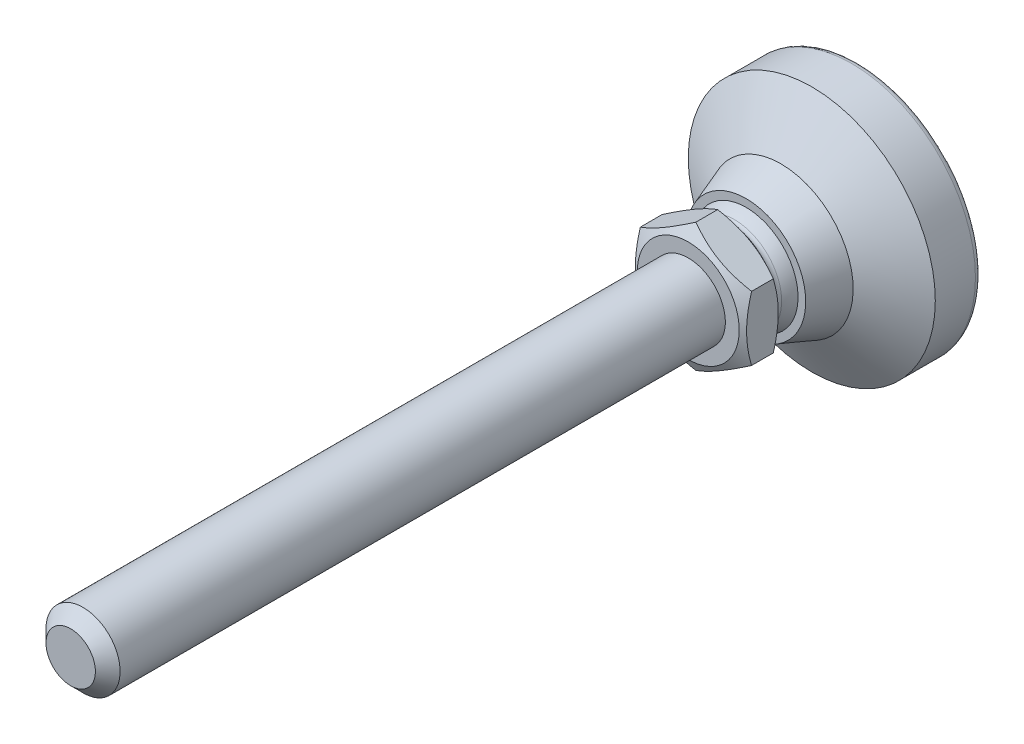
ISO-10303-21;
HEADER;
FILE_DESCRIPTION(('STEP AP214'),'2;1');
FILE_NAME('part.step','',(''),(''),'','','');
FILE_SCHEMA(('AUTOMOTIVE_DESIGN { 1 0 10303 214 1 1 1 1 }'));
ENDSEC;
DATA;
#1=APPLICATION_CONTEXT('core data for automotive mechanical design processes');
#2=APPLICATION_PROTOCOL_DEFINITION('international standard','automotive_design',2000,#1);
#3=PRODUCT_CONTEXT('',#1,'mechanical');
#4=PRODUCT('Part','Part','',(#3));
#5=PRODUCT_RELATED_PRODUCT_CATEGORY('part','',(#4));
#6=PRODUCT_DEFINITION_FORMATION('','',#4);
#7=PRODUCT_DEFINITION_CONTEXT('part definition',#1,'design');
#8=PRODUCT_DEFINITION('design','',#6,#7);
#9=PRODUCT_DEFINITION_SHAPE('','',#8);
#10=(LENGTH_UNIT() NAMED_UNIT(*) SI_UNIT(.MILLI.,.METRE.));
#11=(NAMED_UNIT(*) PLANE_ANGLE_UNIT() SI_UNIT($,.RADIAN.));
#12=(NAMED_UNIT(*) SI_UNIT($,.STERADIAN.) SOLID_ANGLE_UNIT());
#13=UNCERTAINTY_MEASURE_WITH_UNIT(LENGTH_MEASURE(1.E-05),#10,'distance_accuracy_value','');
#14=(GEOMETRIC_REPRESENTATION_CONTEXT(3) GLOBAL_UNCERTAINTY_ASSIGNED_CONTEXT((#13)) GLOBAL_UNIT_ASSIGNED_CONTEXT((#10,
#11,#12)) REPRESENTATION_CONTEXT('',''));
#15=CARTESIAN_POINT('',(0.,0.,0.));
#16=DIRECTION('',(0.,0.,1.));
#17=DIRECTION('',(1.,0.,0.));
#18=AXIS2_PLACEMENT_3D('',#15,#16,#17);
#19=CARTESIAN_POINT('',(0.,0.,20.5000000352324));
#20=DIRECTION('',(0.,0.,-1.));
#21=DIRECTION('',(0.,1.,0.));
#22=AXIS2_PLACEMENT_3D('',#19,#20,#21);
#23=TOROIDAL_SURFACE('',#22,8.50000006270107,0.999999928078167);
#24=CARTESIAN_POINT('',(0.,0.,20.0101291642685));
#25=DIRECTION('',(0.,0.,-1.));
#26=DIRECTION('',(0.,1.,0.));
#27=AXIS2_PLACEMENT_3D('',#24,#25,#26);
#28=CIRCLE('',#27,7.62820514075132);
#29=CARTESIAN_POINT('',(-7.6282051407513,0.,20.0101291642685));
#30=VERTEX_POINT('',#29);
#31=EDGE_CURVE('E73',#30,#30,#28,.T.);
#32=ORIENTED_EDGE('',*,*,#31,.F.);
#33=EDGE_LOOP('',(#32));
#34=FACE_BOUND('',#33,.T.);
#35=CARTESIAN_POINT('',(0.,0.,21.4999999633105));
#36=DIRECTION('',(0.,0.,-1.));
#37=DIRECTION('',(0.,1.,0.));
#38=AXIS2_PLACEMENT_3D('',#35,#36,#37);
#39=CIRCLE('',#38,8.50000006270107);
#40=CARTESIAN_POINT('',(0.,8.50000006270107,21.4999999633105));
#41=VERTEX_POINT('',#40);
#42=EDGE_CURVE('E78',#41,#41,#39,.F.);
#43=ORIENTED_EDGE('',*,*,#42,.F.);
#44=EDGE_LOOP('',(#43));
#45=FACE_BOUND('',#44,.T.);
#46=ADVANCED_FACE('F14',(#34,#45),#23,.F.);
#47=CARTESIAN_POINT('',(0.,0.,15.723757));
#48=DIRECTION('',(0.,0.,-1.));
#49=DIRECTION('',(-1.,0.,0.));
#50=AXIS2_PLACEMENT_3D('',#47,#48,#49);
#51=SPHERICAL_SURFACE('',#50,8.75);
#52=CARTESIAN_POINT('',(0.,0.,18.135983));
#53=DIRECTION('',(0.,0.,-1.));
#54=DIRECTION('',(0.,1.,0.));
#55=AXIS2_PLACEMENT_3D('',#52,#53,#54);
#56=CIRCLE('',#55,8.4109253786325);
#57=CARTESIAN_POINT('',(-8.41092537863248,0.,18.135983));
#58=VERTEX_POINT('',#57);
#59=EDGE_CURVE('E109',#58,#58,#56,.T.);
#60=CARTESIAN_POINT('',(-8.41092537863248,0.,18.135983));
#61=CARTESIAN_POINT('',(-8.40507970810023,0.,18.1563656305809));
#62=CARTESIAN_POINT('',(-8.39915994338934,0.,18.1767270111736));
#63=CARTESIAN_POINT('',(-8.38717254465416,0.,18.2174061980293));
#64=CARTESIAN_POINT('',(-8.38110491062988,0.,18.2377240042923));
#65=CARTESIAN_POINT('',(-8.36882209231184,0.,18.2783149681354));
#66=CARTESIAN_POINT('',(-8.36260690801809,0.,18.2985881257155));
#67=CARTESIAN_POINT('',(-8.35002931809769,0.,18.3390887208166));
#68=CARTESIAN_POINT('',(-8.34366691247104,0.,18.3593161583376));
#69=CARTESIAN_POINT('',(-8.33079521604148,0.,18.3997242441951));
#70=CARTESIAN_POINT('',(-8.32428592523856,0.,18.4199048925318));
#71=CARTESIAN_POINT('',(-8.31112080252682,0.,18.4602183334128));
#72=CARTESIAN_POINT('',(-8.304464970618,0.,18.4803511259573));
#73=CARTESIAN_POINT('',(-8.29100711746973,0.,18.5205677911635));
#74=CARTESIAN_POINT('',(-8.28420509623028,0.,18.5406516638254));
#75=CARTESIAN_POINT('',(-8.27045522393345,0.,18.5807694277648));
#76=CARTESIAN_POINT('',(-8.26350737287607,0.,18.6008033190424));
#77=CARTESIAN_POINT('',(-8.24946620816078,0.,18.6408200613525));
#78=CARTESIAN_POINT('',(-8.24237289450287,0.,18.660802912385));
#79=CARTESIAN_POINT('',(-8.22804117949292,0.,18.7007165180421));
#80=CARTESIAN_POINT('',(-8.22080277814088,0.,18.7206472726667));
#81=CARTESIAN_POINT('',(-8.20618127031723,0.,18.7604556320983));
#82=CARTESIAN_POINT('',(-8.19879816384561,0.,18.7803332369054));
#83=CARTESIAN_POINT('',(-8.18388763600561,0.,18.8200342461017));
#84=CARTESIAN_POINT('',(-8.17636021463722,0.,18.839857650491));
#85=CARTESIAN_POINT('',(-8.16116145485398,0.,18.8794492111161));
#86=CARTESIAN_POINT('',(-8.15349011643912,0.,18.8992173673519));
#87=CARTESIAN_POINT('',(-8.1380039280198,0.,18.9386973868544));
#88=CARTESIAN_POINT('',(-8.13018907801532,0.,18.9584092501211));
#89=CARTESIAN_POINT('',(-8.11441627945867,0.,18.9977756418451));
#90=CARTESIAN_POINT('',(-8.10645833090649,0.,19.0174301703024));
#91=CARTESIAN_POINT('',(-8.09039975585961,0.,19.0566808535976));
#92=CARTESIAN_POINT('',(-8.08229912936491,0.,19.0762770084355));
#93=CARTESIAN_POINT('',(-8.06595562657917,0.,19.1154099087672));
#94=CARTESIAN_POINT('',(-8.05771275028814,0.,19.1349466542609));
#95=CARTESIAN_POINT('',(-8.04108518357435,0.,19.1739597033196));
#96=CARTESIAN_POINT('',(-8.03270049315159,0.,19.1934360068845));
#97=CARTESIAN_POINT('',(-8.0157897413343,0.,19.2323271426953));
#98=CARTESIAN_POINT('',(-8.00726367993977,0.,19.2517419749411));
#99=CARTESIAN_POINT('',(-7.99007063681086,0.,19.2905091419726));
#100=CARTESIAN_POINT('',(-7.98140365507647,0.,19.3098614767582));
#101=CARTESIAN_POINT('',(-7.96392922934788,0.,19.3485026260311));
#102=CARTESIAN_POINT('',(-7.95512178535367,0.,19.3677914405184));
#103=CARTESIAN_POINT('',(-7.9373669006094,0.,19.4063045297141));
#104=CARTESIAN_POINT('',(-7.92841945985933,0.,19.4255288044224));
#105=CARTESIAN_POINT('',(-7.91038505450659,0.,19.4639117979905));
#106=CARTESIAN_POINT('',(-7.90129808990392,0.,19.4830705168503));
#107=CARTESIAN_POINT('',(-7.88298511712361,0.,19.5213213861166));
#108=CARTESIAN_POINT('',(-7.87375910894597,0.,19.540413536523));
#109=CARTESIAN_POINT('',(-7.85516853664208,0.,19.5785302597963));
#110=CARTESIAN_POINT('',(-7.84580397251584,0.,19.5975548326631));
#111=CARTESIAN_POINT('',(-7.826936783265,0.,19.6355353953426));
#112=CARTESIAN_POINT('',(-7.8174341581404,0.,19.6544913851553));
#113=CARTESIAN_POINT('',(-7.79829134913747,0.,19.6923337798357));
#114=CARTESIAN_POINT('',(-7.78865116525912,0.,19.7112201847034));
#115=CARTESIAN_POINT('',(-7.76923374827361,0.,19.7489224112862));
#116=CARTESIAN_POINT('',(-7.75945651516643,0.,19.7677382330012));
#117=CARTESIAN_POINT('',(-7.73976551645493,0.,19.8052982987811));
#118=CARTESIAN_POINT('',(-7.72985175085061,0.,19.824042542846));
#119=CARTESIAN_POINT('',(-7.7098882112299,0.,19.8614584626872));
#120=CARTESIAN_POINT('',(-7.69983843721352,0.,19.8801301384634));
#121=CARTESIAN_POINT('',(-7.67960341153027,0.,19.9173999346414));
#122=CARTESIAN_POINT('',(-7.6694181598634,0.,19.9359980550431));
#123=CARTESIAN_POINT('',(-7.6489127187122,0.,19.9731197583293));
#124=CARTESIAN_POINT('',(-7.63859252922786,0.,19.9916433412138));
#125=CARTESIAN_POINT('',(-7.6282051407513,0.,20.0101291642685));
#126=B_SPLINE_CURVE_WITH_KNOTS('',3,(#60,#61,#62,#63,#64,#65,#66,#67,#68,#69,#70,#71,#72,#73,
#74,#75,#76,#77,#78,#79,#80,#81,#82,#83,#84,#85,#86,#87,#88,#89,#90,#91,#92,#93,#94,#95,#96,#97,
#98,#99,#100,#101,#102,#103,#104,#105,#106,#107,#108,#109,#110,#111,#112,#113,#114,#115,#116,
#117,#118,#119,#120,#121,#122,#123,#124,#125),.UNSPECIFIED.,.F.,.F.,(4,2,2,2,2,2,2,2,2,2,2,2,2,
2,2,2,2,2,2,2,2,2,2,2,2,2,2,2,2,2,2,2,4),(0.,0.0636128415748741,0.127225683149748,
0.190838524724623,0.254451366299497,0.31806420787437,0.381677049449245,0.445289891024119,
0.508902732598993,0.572515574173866,0.636128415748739,0.699741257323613,0.763354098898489,
0.826966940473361,0.890579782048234,0.954192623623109,1.01780546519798,1.08141830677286,
1.14503114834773,1.2086439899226,1.27225683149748,1.33586967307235,1.39948251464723,
1.4630953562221,1.52670819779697,1.59032103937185,1.65393388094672,1.7175467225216,
1.78115956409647,1.84477240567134,1.90838524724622,1.97199808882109,2.03561093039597),.UNSPECIFIED.);
#127=EDGE_CURVE('BSEAM224',#58,#30,#126,.T.);
#128=ORIENTED_EDGE('',*,*,#59,.F.);
#129=ORIENTED_EDGE('',*,*,#31,.T.);
#130=ORIENTED_EDGE('',*,*,#127,.T.);
#131=ORIENTED_EDGE('',*,*,#127,.F.);
#132=EDGE_LOOP('',(#128,#130,#129,#131));
#133=FACE_BOUND('',#132,.T.);
#134=ADVANCED_FACE('F224',(#133),#51,.T.);
#135=CARTESIAN_POINT('',(-8.4109253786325,0.,18.135983));
#136=DIRECTION('',(0.,0.,-1.));
#137=DIRECTION('',(0.,1.,0.));
#138=AXIS2_PLACEMENT_3D('',#135,#136,#137);
#139=PLANE('',#138);
#140=CARTESIAN_POINT('',(0.,0.,18.135983));
#141=DIRECTION('',(0.,0.,-1.));
#142=DIRECTION('',(0.,1.,0.));
#143=AXIS2_PLACEMENT_3D('',#140,#141,#142);
#144=CIRCLE('',#143,9.649999);
#145=CARTESIAN_POINT('',(0.,9.649999,18.135983));
#146=VERTEX_POINT('',#145);
#147=EDGE_CURVE('E106',#146,#146,#144,.T.);
#148=ORIENTED_EDGE('',*,*,#147,.F.);
#149=EDGE_LOOP('',(#148));
#150=FACE_BOUND('',#149,.T.);
#151=ORIENTED_EDGE('',*,*,#59,.T.);
#152=EDGE_LOOP('',(#151));
#153=FACE_BOUND('',#152,.T.);
#154=ADVANCED_FACE('F220',(#150,#153),#139,.F.);
#155=CARTESIAN_POINT('',(0.,0.,18.135983));
#156=DIRECTION('',(0.,0.,-1.));
#157=DIRECTION('',(0.,1.,0.));
#158=AXIS2_PLACEMENT_3D('',#155,#156,#157);
#159=CONICAL_SURFACE('',#158,9.649999,0.349065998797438);
#160=CARTESIAN_POINT('',(0.,0.,12.5));
#161=DIRECTION('',(0.,0.,-1.));
#162=DIRECTION('',(0.,1.,0.));
#163=AXIS2_PLACEMENT_3D('',#160,#161,#162);
#164=CIRCLE('',#163,11.70133);
#165=CARTESIAN_POINT('',(0.,11.70133,12.5));
#166=VERTEX_POINT('',#165);
#167=EDGE_CURVE('E103',#166,#166,#164,.T.);
#168=ORIENTED_EDGE('',*,*,#167,.F.);
#169=EDGE_LOOP('',(#168));
#170=FACE_BOUND('',#169,.T.);
#171=ORIENTED_EDGE('',*,*,#147,.T.);
#172=EDGE_LOOP('',(#171));
#173=FACE_BOUND('',#172,.T.);
#174=ADVANCED_FACE('F216',(#170,#173),#159,.T.);
#175=CARTESIAN_POINT('',(0.,0.,12.5));
#176=DIRECTION('',(0.,0.,-1.));
#177=DIRECTION('',(0.,1.,0.));
#178=AXIS2_PLACEMENT_3D('',#175,#176,#177);
#179=CONICAL_SURFACE('',#178,11.70133,1.02853608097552);
#180=CARTESIAN_POINT('',(0.,0.,7.5));
#181=DIRECTION('',(0.,0.,-1.));
#182=DIRECTION('',(0.,1.,0.));
#183=AXIS2_PLACEMENT_3D('',#180,#181,#182);
#184=CIRCLE('',#183,20.);
#185=CARTESIAN_POINT('',(0.,20.,7.5));
#186=VERTEX_POINT('',#185);
#187=EDGE_CURVE('E100',#186,#186,#184,.T.);
#188=ORIENTED_EDGE('',*,*,#187,.F.);
#189=EDGE_LOOP('',(#188));
#190=FACE_BOUND('',#189,.T.);
#191=ORIENTED_EDGE('',*,*,#167,.T.);
#192=EDGE_LOOP('',(#191));
#193=FACE_BOUND('',#192,.T.);
#194=ADVANCED_FACE('F212',(#190,#193),#179,.T.);
#195=CARTESIAN_POINT('',(0.,0.,0.));
#196=DIRECTION('',(0.,0.,-1.));
#197=DIRECTION('',(0.,1.,0.));
#198=AXIS2_PLACEMENT_3D('',#195,#196,#197);
#199=CYLINDRICAL_SURFACE('',#198,20.);
#200=CARTESIAN_POINT('',(0.,0.,1.));
#201=DIRECTION('',(0.,0.,-1.));
#202=DIRECTION('',(0.,1.,0.));
#203=AXIS2_PLACEMENT_3D('',#200,#201,#202);
#204=CIRCLE('',#203,20.);
#205=CARTESIAN_POINT('',(0.,20.,1.));
#206=VERTEX_POINT('',#205);
#207=EDGE_CURVE('E97',#206,#206,#204,.T.);
#208=ORIENTED_EDGE('',*,*,#207,.F.);
#209=EDGE_LOOP('',(#208));
#210=FACE_BOUND('',#209,.T.);
#211=ORIENTED_EDGE('',*,*,#187,.T.);
#212=EDGE_LOOP('',(#211));
#213=FACE_BOUND('',#212,.T.);
#214=ADVANCED_FACE('F208',(#210,#213),#199,.T.);
#215=CARTESIAN_POINT('',(0.,0.,1.));
#216=DIRECTION('',(0.,0.,-1.));
#217=DIRECTION('',(0.,1.,0.));
#218=AXIS2_PLACEMENT_3D('',#215,#216,#217);
#219=TOROIDAL_SURFACE('',#218,19.,1.);
#220=CARTESIAN_POINT('',(0.,0.,0.));
#221=DIRECTION('',(0.,0.,-1.));
#222=DIRECTION('',(0.,1.,0.));
#223=AXIS2_PLACEMENT_3D('',#220,#221,#222);
#224=CIRCLE('',#223,19.);
#225=CARTESIAN_POINT('',(0.,19.,0.));
#226=VERTEX_POINT('',#225);
#227=EDGE_CURVE('E94',#226,#226,#224,.T.);
#228=ORIENTED_EDGE('',*,*,#227,.F.);
#229=EDGE_LOOP('',(#228));
#230=FACE_BOUND('',#229,.T.);
#231=ORIENTED_EDGE('',*,*,#207,.T.);
#232=EDGE_LOOP('',(#231));
#233=FACE_BOUND('',#232,.T.);
#234=ADVANCED_FACE('F204',(#230,#233),#219,.T.);
#235=CARTESIAN_POINT('',(-19.,0.,0.));
#236=DIRECTION('',(0.,0.,1.));
#237=DIRECTION('',(0.,-1.,0.));
#238=AXIS2_PLACEMENT_3D('',#235,#236,#237);
#239=PLANE('',#238);
#240=ORIENTED_EDGE('',*,*,#227,.T.);
#241=EDGE_LOOP('',(#240));
#242=FACE_BOUND('',#241,.T.);
#243=ADVANCED_FACE('F200',(#242),#239,.F.);
#244=CARTESIAN_POINT('',(0.,8.25,21.4999999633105));
#245=DIRECTION('',(0.,0.,-1.));
#246=DIRECTION('',(0.,1.,0.));
#247=AXIS2_PLACEMENT_3D('',#244,#245,#246);
#248=PLANE('',#247);
#249=ORIENTED_EDGE('',*,*,#42,.T.);
#250=EDGE_LOOP('',(#249));
#251=FACE_BOUND('',#250,.T.);
#252=CARTESIAN_POINT('',(0.,0.,21.4999999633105));
#253=DIRECTION('',(0.,0.,-1.));
#254=DIRECTION('',(0.,1.,0.));
#255=AXIS2_PLACEMENT_3D('',#252,#253,#254);
#256=CIRCLE('',#255,8.25);
#257=CARTESIAN_POINT('',(0.,8.25,21.4999999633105));
#258=VERTEX_POINT('',#257);
#259=EDGE_CURVE('E292',#258,#258,#256,.T.);
#260=ORIENTED_EDGE('',*,*,#259,.T.);
#261=EDGE_LOOP('',(#260));
#262=FACE_BOUND('',#261,.T.);
#263=ADVANCED_FACE('F129',(#251,#262),#248,.F.);
#264=CARTESIAN_POINT('',(0.,0.,23.6858734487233));
#265=DIRECTION('',(0.,0.,1.));
#266=DIRECTION('',(0.,-1.,0.));
#267=AXIS2_PLACEMENT_3D('',#264,#265,#266);
#268=CONICAL_SURFACE('',#267,12.0360439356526,1.0471975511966);
#269=CARTESIAN_POINT('',(0.000200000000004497,-10.4000990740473,22.7413602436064));
#270=CARTESIAN_POINT('',(-0.197753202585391,-10.2858107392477,22.6753792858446));
#271=CARTESIAN_POINT('',(-0.396478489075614,-10.1710766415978,22.612392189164));
#272=CARTESIAN_POINT('',(-0.795542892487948,-9.9406767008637,22.4932318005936));
#273=CARTESIAN_POINT('',(-0.995882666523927,-9.82501047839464,22.4370614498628));
#274=CARTESIAN_POINT('',(-1.39854780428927,-9.59253165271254,22.3322959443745));
#275=CARTESIAN_POINT('',(-1.60087672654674,-9.47571699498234,22.283718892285));
#276=CARTESIAN_POINT('',(-2.00691067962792,-9.2412931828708,22.1951912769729));
#277=CARTESIAN_POINT('',(-2.21061542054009,-9.12368419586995,22.1552389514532));
#278=CARTESIAN_POINT('',(-2.61423624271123,-8.8906536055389,22.0856465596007));
#279=CARTESIAN_POINT('',(-2.81412251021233,-8.77524921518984,22.055777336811));
#280=CARTESIAN_POINT('',(-3.21478942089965,-8.54392406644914,22.0056961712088));
#281=CARTESIAN_POINT('',(-3.41556998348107,-8.42800335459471,21.9854833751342));
#282=CARTESIAN_POINT('',(-3.81747936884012,-8.19596086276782,21.9552199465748));
#283=CARTESIAN_POINT('',(-4.01860753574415,-8.07983946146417,21.9451577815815));
#284=CARTESIAN_POINT('',(-4.42104897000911,-7.84748979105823,21.9354133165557));
#285=CARTESIAN_POINT('',(-4.62236223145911,-7.73126152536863,21.9357306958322));
#286=CARTESIAN_POINT('',(-4.99872349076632,-7.51396925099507,21.9460227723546));
#287=CARTESIAN_POINT('',(-5.17379802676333,-7.41288992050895,21.9547419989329));
#288=CARTESIAN_POINT('',(-5.52353701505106,-7.21096802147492,21.9798611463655));
#289=CARTESIAN_POINT('',(-5.69820143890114,-7.11012546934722,21.9962615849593));
#290=CARTESIAN_POINT('',(-6.2215185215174,-6.8079882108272,22.0565970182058));
#291=CARTESIAN_POINT('',(-6.56924487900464,-6.60722830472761,22.1116585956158));
#292=CARTESIAN_POINT('',(-7.26838615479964,-6.20357890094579,22.2493132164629));
#293=CARTESIAN_POINT('',(-7.61971184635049,-6.00074091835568,22.3324897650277));
#294=CARTESIAN_POINT('',(-8.31712409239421,-5.59808977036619,22.5212660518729));
#295=CARTESIAN_POINT('',(-8.66321957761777,-5.39827144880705,22.6268214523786));
#296=CARTESIAN_POINT('',(-9.00685,-5.19987633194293,22.7413602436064));
#297=B_SPLINE_CURVE_WITH_KNOTS('',3,(#269,#270,#271,#272,#273,#274,#275,#276,#277,#278,#279,
#280,#281,#282,#283,#284,#285,#286,#287,#288,#289,#290,#291,#292,#293,#294,#295,#296),
.UNSPECIFIED.,.F.,.F.,(4,2,2,2,2,2,2,2,2,2,2,2,2,4),(0.,0.713746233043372,1.42779933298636,
2.14352961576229,2.85911351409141,3.55712384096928,4.25507247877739,4.95222725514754,
5.64936049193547,6.25624894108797,6.86317830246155,8.07790154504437,9.31956468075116,
10.5587904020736),.UNSPECIFIED.);
#298=CARTESIAN_POINT('',(0.,-10.3999836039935,22.7412935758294));
#299=VERTEX_POINT('',#298);
#300=CARTESIAN_POINT('',(-9.00665,-5.19999180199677,22.7412935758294));
#301=VERTEX_POINT('',#300);
#302=EDGE_CURVE('E69',#299,#301,#297,.T.);
#303=ORIENTED_EDGE('',*,*,#302,.T.);
#304=CARTESIAN_POINT('',(-9.00665,13.8616920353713,26.2809028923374));
#305=CARTESIAN_POINT('',(-9.00665,13.6654409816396,26.1858936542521));
#306=CARTESIAN_POINT('',(-9.00665,13.4689567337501,26.091366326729));
#307=CARTESIAN_POINT('',(-9.00665,13.0754731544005,25.9033848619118));
#308=CARTESIAN_POINT('',(-9.00665,12.8784738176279,25.8099307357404));
#309=CARTESIAN_POINT('',(-9.00665,12.2865761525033,25.5313168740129));
#310=CARTESIAN_POINT('',(-9.00665,11.890837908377,25.3479346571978));
#311=CARTESIAN_POINT('',(-9.00665,11.0944722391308,24.9860295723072));
#312=CARTESIAN_POINT('',(-9.00665,10.6938298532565,24.8075395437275));
#313=CARTESIAN_POINT('',(-9.00665,9.88932161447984,24.4580047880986));
#314=CARTESIAN_POINT('',(-9.00665,9.48545591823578,24.2869597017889));
#315=CARTESIAN_POINT('',(-9.00665,8.66126717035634,23.9491279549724));
#316=CARTESIAN_POINT('',(-9.00665,8.24082199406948,23.7826375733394));
#317=CARTESIAN_POINT('',(-9.00665,7.39497483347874,23.4625161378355));
#318=CARTESIAN_POINT('',(-9.00665,6.96957229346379,23.3088865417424));
#319=CARTESIAN_POINT('',(-9.00665,6.11395945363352,23.0185983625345));
#320=CARTESIAN_POINT('',(-9.00665,5.68376125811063,22.8819044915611));
#321=CARTESIAN_POINT('',(-9.00665,4.81721135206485,22.6299415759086));
#322=CARTESIAN_POINT('',(-9.00665,4.38086166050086,22.5146656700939));
#323=CARTESIAN_POINT('',(-9.00665,3.50407316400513,22.3117514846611));
#324=CARTESIAN_POINT('',(-9.00665,3.06366882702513,22.2239683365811));
#325=CARTESIAN_POINT('',(-9.00665,2.39913833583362,22.1167695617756));
#326=CARTESIAN_POINT('',(-9.00665,2.17695709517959,22.0851144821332));
#327=CARTESIAN_POINT('',(-9.00665,1.73152673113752,22.0305861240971));
#328=CARTESIAN_POINT('',(-9.00665,1.50827771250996,22.0077120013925));
#329=CARTESIAN_POINT('',(-9.00665,1.06388097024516,21.9714827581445));
#330=CARTESIAN_POINT('',(-9.00665,0.842742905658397,21.95800959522));
#331=CARTESIAN_POINT('',(-9.00665,0.400095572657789,21.9404191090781));
#332=CARTESIAN_POINT('',(-9.00665,0.178586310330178,21.9363016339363));
#333=CARTESIAN_POINT('',(-9.00665,-0.264409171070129,21.9375204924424));
#334=CARTESIAN_POINT('',(-9.00665,-0.48589538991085,21.9428569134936));
#335=CARTESIAN_POINT('',(-9.00665,-0.928449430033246,21.9628552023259));
#336=CARTESIAN_POINT('',(-9.00665,-1.14951723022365,21.97751752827));
#337=CARTESIAN_POINT('',(-9.00665,-1.684047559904,22.0239384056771));
#338=CARTESIAN_POINT('',(-9.00665,-1.99711701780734,22.0603011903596));
#339=CARTESIAN_POINT('',(-9.00665,-2.62086392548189,22.1497241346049));
#340=CARTESIAN_POINT('',(-9.00665,-2.9315410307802,22.2027866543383));
#341=CARTESIAN_POINT('',(-9.00665,-3.55022994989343,22.3237212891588));
#342=CARTESIAN_POINT('',(-9.00665,-3.85823942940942,22.3916052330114));
#343=CARTESIAN_POINT('',(-9.00665,-4.47113570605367,22.5401177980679));
#344=CARTESIAN_POINT('',(-9.00665,-4.77602255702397,22.6207461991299));
#345=CARTESIAN_POINT('',(-9.00665,-5.38935596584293,22.7946919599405));
#346=CARTESIAN_POINT('',(-9.00665,-5.69773419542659,22.8882485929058));
#347=CARTESIAN_POINT('',(-9.00665,-6.31145161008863,23.0847988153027));
#348=CARTESIAN_POINT('',(-9.00665,-6.61679077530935,23.1877924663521));
#349=CARTESIAN_POINT('',(-9.00665,-7.22458536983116,23.4016014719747));
#350=CARTESIAN_POINT('',(-9.00665,-7.52704176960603,23.5124140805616));
#351=CARTESIAN_POINT('',(-9.00665,-8.12946328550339,23.7405798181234));
#352=CARTESIAN_POINT('',(-9.00665,-8.42942842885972,23.8579328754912));
#353=CARTESIAN_POINT('',(-9.00665,-9.12958685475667,24.1392459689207));
#354=CARTESIAN_POINT('',(-9.00665,-9.52889894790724,24.3053957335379));
#355=CARTESIAN_POINT('',(-9.00665,-10.3242131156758,24.6454588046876));
#356=CARTESIAN_POINT('',(-9.00665,-10.7202149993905,24.8193725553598));
#357=CARTESIAN_POINT('',(-9.00665,-11.5095170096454,25.1734274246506));
#358=CARTESIAN_POINT('',(-9.00665,-11.9028165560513,25.3535698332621));
#359=CARTESIAN_POINT('',(-9.00665,-12.6870774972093,25.7188425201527));
#360=CARTESIAN_POINT('',(-9.00665,-13.0780389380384,25.9039726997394));
#361=CARTESIAN_POINT('',(-9.00665,-13.8584126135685,26.2784926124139));
#362=CARTESIAN_POINT('',(-9.00665,-14.2478228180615,26.4678865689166));
#363=CARTESIAN_POINT('',(-9.00665,-15.0249914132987,26.8500323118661));
#364=CARTESIAN_POINT('',(-9.00665,-15.4127497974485,27.0427841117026));
#365=CARTESIAN_POINT('',(-9.00665,-16.5738448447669,27.6251476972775));
#366=CARTESIAN_POINT('',(-9.00665,-17.3450974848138,28.018914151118));
#367=CARTESIAN_POINT('',(-9.00665,-18.8204348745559,28.781642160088));
#368=CARTESIAN_POINT('',(-9.00665,-19.5248391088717,29.1499884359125));
#369=CARTESIAN_POINT('',(-9.00665,-20.931046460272,29.89166544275));
#370=CARTESIAN_POINT('',(-9.00665,-21.6328494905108,30.2649963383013));
#371=CARTESIAN_POINT('',(-9.00665,-23.0327591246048,31.0145722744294));
#372=CARTESIAN_POINT('',(-9.00665,-23.7308705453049,31.3908083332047));
#373=CARTESIAN_POINT('',(-9.00665,-25.125426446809,32.1462715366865));
#374=CARTESIAN_POINT('',(-9.00665,-25.8218710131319,32.5254985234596));
#375=CARTESIAN_POINT('',(-9.00665,-26.5176998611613,32.9058444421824));
#376=B_SPLINE_CURVE_WITH_KNOTS('',3,(#304,#305,#306,#307,#308,#309,#310,#311,#312,#313,#314,
#315,#316,#317,#318,#319,#320,#321,#322,#323,#324,#325,#326,#327,#328,#329,#330,#331,#332,#333,
#334,#335,#336,#337,#338,#339,#340,#341,#342,#343,#344,#345,#346,#347,#348,#349,#350,#351,#352,
#353,#354,#355,#356,#357,#358,#359,#360,#361,#362,#363,#364,#365,#366,#367,#368,#369,#370,#371,
#372,#373,#374,#375),.UNSPECIFIED.,.F.,.F.,(4,2,2,2,2,2,2,2,2,2,2,2,2,2,2,2,2,2,2,2,2,2,2,2,2,2,
2,2,2,2,2,2,2,2,2,4),(0.,0.654117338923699,1.30824145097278,2.61668888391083,3.93244019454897,
5.24812794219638,6.60459256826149,7.96121074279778,9.31495290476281,10.6682606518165,
12.0143124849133,12.6874409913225,13.3605047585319,14.0249573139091,14.6893990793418,
15.3538469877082,16.0183275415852,16.9633247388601,17.9084555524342,18.8543434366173,
19.8002149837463,20.7668068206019,21.7334049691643,22.6996653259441,23.6659151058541,
24.9633030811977,26.2607653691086,27.5584979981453,28.8562049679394,30.1552594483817,
31.4543191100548,34.052118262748,36.4367937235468,38.8215480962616,41.2006616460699,
43.5796503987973),.UNSPECIFIED.);
#377=CARTESIAN_POINT('',(-9.00665,5.19999180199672,22.7412935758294));
#378=VERTEX_POINT('',#377);
#379=EDGE_CURVE('E79',#301,#378,#376,.F.);
#380=ORIENTED_EDGE('',*,*,#379,.T.);
#381=CARTESIAN_POINT('',(-9.00685,5.19987633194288,22.7413602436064));
#382=CARTESIAN_POINT('',(-8.80889679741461,5.3141646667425,22.6753792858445));
#383=CARTESIAN_POINT('',(-8.61017151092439,5.42889876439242,22.612392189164));
#384=CARTESIAN_POINT('',(-8.21110710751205,5.65929870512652,22.4932318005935));
#385=CARTESIAN_POINT('',(-8.01076733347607,5.77496492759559,22.4370614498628));
#386=CARTESIAN_POINT('',(-7.60810219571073,6.00744375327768,22.3322959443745));
#387=CARTESIAN_POINT('',(-7.40577327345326,6.12425841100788,22.2837188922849));
#388=CARTESIAN_POINT('',(-6.99973932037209,6.35868222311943,22.1951912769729));
#389=CARTESIAN_POINT('',(-6.79603457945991,6.47629121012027,22.1552389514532));
#390=CARTESIAN_POINT('',(-6.39241375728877,6.70932180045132,22.0856465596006));
#391=CARTESIAN_POINT('',(-6.19252748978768,6.82472619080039,22.0557773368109));
#392=CARTESIAN_POINT('',(-5.79186057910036,7.05605133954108,22.0056961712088));
#393=CARTESIAN_POINT('',(-5.59108001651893,7.17197205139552,21.9854833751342));
#394=CARTESIAN_POINT('',(-5.18917063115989,7.4040145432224,21.9552199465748));
#395=CARTESIAN_POINT('',(-4.98804246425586,7.52013594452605,21.9451577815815));
#396=CARTESIAN_POINT('',(-4.5856010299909,7.75248561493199,21.9354133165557));
#397=CARTESIAN_POINT('',(-4.3842877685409,7.86871388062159,21.9357306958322));
#398=CARTESIAN_POINT('',(-4.00792650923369,8.08600615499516,21.9460227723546));
#399=CARTESIAN_POINT('',(-3.83285197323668,8.18708548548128,21.9547419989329));
#400=CARTESIAN_POINT('',(-3.48311298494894,8.3890073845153,21.9798611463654));
#401=CARTESIAN_POINT('',(-3.30844856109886,8.489849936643,21.9962615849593));
#402=CARTESIAN_POINT('',(-2.78513147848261,8.79198719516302,22.0565970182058));
#403=CARTESIAN_POINT('',(-2.43740512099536,8.99274710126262,22.1116585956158));
#404=CARTESIAN_POINT('',(-1.73826384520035,9.39639650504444,22.2493132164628));
#405=CARTESIAN_POINT('',(-1.38693815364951,9.59923448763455,22.3324897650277));
#406=CARTESIAN_POINT('',(-0.689525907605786,10.001885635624,22.5212660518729));
#407=CARTESIAN_POINT('',(-0.343430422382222,10.2017039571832,22.6268214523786));
#408=CARTESIAN_POINT('',(0.000200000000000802,10.4000990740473,22.7413602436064));
#409=B_SPLINE_CURVE_WITH_KNOTS('',3,(#381,#382,#383,#384,#385,#386,#387,#388,#389,#390,#391,
#392,#393,#394,#395,#396,#397,#398,#399,#400,#401,#402,#403,#404,#405,#406,#407,#408),
.UNSPECIFIED.,.F.,.F.,(4,2,2,2,2,2,2,2,2,2,2,2,2,4),(0.,0.713746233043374,1.42779933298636,
2.14352961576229,2.85911351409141,3.55712384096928,4.25507247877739,4.95222725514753,
5.64936049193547,6.25624894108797,6.86317830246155,8.07790154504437,9.31956468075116,
10.5587904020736),.UNSPECIFIED.);
#410=CARTESIAN_POINT('',(0.,10.3999836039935,22.7412935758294));
#411=VERTEX_POINT('',#410);
#412=EDGE_CURVE('E152',#378,#411,#409,.T.);
#413=ORIENTED_EDGE('',*,*,#412,.T.);
#414=CARTESIAN_POINT('',(-0.000199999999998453,10.4000990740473,22.7413602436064));
#415=CARTESIAN_POINT('',(0.19775320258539,10.2858107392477,22.6753792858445));
#416=CARTESIAN_POINT('',(0.396478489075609,10.1710766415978,22.612392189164));
#417=CARTESIAN_POINT('',(0.795542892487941,9.94067670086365,22.4932318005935));
#418=CARTESIAN_POINT('',(0.99588266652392,9.82501047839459,22.4370614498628));
#419=CARTESIAN_POINT('',(1.39854780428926,9.59253165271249,22.3322959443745));
#420=CARTESIAN_POINT('',(1.60087672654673,9.4757169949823,22.2837188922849));
#421=CARTESIAN_POINT('',(2.00691067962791,9.24129318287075,22.1951912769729));
#422=CARTESIAN_POINT('',(2.21061542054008,9.12368419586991,22.1552389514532));
#423=CARTESIAN_POINT('',(2.61423624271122,8.89065360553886,22.0856465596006));
#424=CARTESIAN_POINT('',(2.81412251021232,8.7752492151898,22.0557773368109));
#425=CARTESIAN_POINT('',(3.21478942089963,8.5439240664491,22.0056961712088));
#426=CARTESIAN_POINT('',(3.41556998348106,8.42800335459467,21.9854833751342));
#427=CARTESIAN_POINT('',(3.81747936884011,8.19596086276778,21.9552199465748));
#428=CARTESIAN_POINT('',(4.01860753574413,8.07983946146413,21.9451577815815));
#429=CARTESIAN_POINT('',(4.42104897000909,7.84748979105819,21.9354133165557));
#430=CARTESIAN_POINT('',(4.62236223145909,7.73126152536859,21.9357306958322));
#431=CARTESIAN_POINT('',(4.9987234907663,7.51396925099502,21.9460227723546));
#432=CARTESIAN_POINT('',(5.17379802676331,7.41288992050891,21.9547419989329));
#433=CARTESIAN_POINT('',(5.52353701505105,7.21096802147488,21.9798611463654));
#434=CARTESIAN_POINT('',(5.69820143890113,7.11012546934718,21.9962615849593));
#435=CARTESIAN_POINT('',(6.22151852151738,6.80798821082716,22.0565970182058));
#436=CARTESIAN_POINT('',(6.56924487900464,6.60722830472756,22.1116585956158));
#437=CARTESIAN_POINT('',(7.26838615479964,6.20357890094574,22.2493132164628));
#438=CARTESIAN_POINT('',(7.61971184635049,6.00074091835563,22.3324897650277));
#439=CARTESIAN_POINT('',(8.31712409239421,5.59808977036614,22.5212660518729));
#440=CARTESIAN_POINT('',(8.66321957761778,5.398271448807,22.6268214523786));
#441=CARTESIAN_POINT('',(9.00685,5.19987633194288,22.7413602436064));
#442=B_SPLINE_CURVE_WITH_KNOTS('',3,(#414,#415,#416,#417,#418,#419,#420,#421,#422,#423,#424,
#425,#426,#427,#428,#429,#430,#431,#432,#433,#434,#435,#436,#437,#438,#439,#440,#441),
.UNSPECIFIED.,.F.,.F.,(4,2,2,2,2,2,2,2,2,2,2,2,2,4),(0.,0.713746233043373,1.42779933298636,
2.14352961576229,2.85911351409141,3.55712384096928,4.25507247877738,4.95222725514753,
5.64936049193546,6.25624894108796,6.86317830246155,8.07790154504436,9.31956468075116,
10.5587904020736),.UNSPECIFIED.);
#443=CARTESIAN_POINT('',(9.00665,5.19999180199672,22.7412935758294));
#444=VERTEX_POINT('',#443);
#445=EDGE_CURVE('E145',#411,#444,#442,.T.);
#446=ORIENTED_EDGE('',*,*,#445,.T.);
#447=CARTESIAN_POINT('',(9.00665,13.8616920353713,26.2809028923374));
#448=CARTESIAN_POINT('',(9.00665,13.6654409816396,26.1858936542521));
#449=CARTESIAN_POINT('',(9.00665,13.4689567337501,26.091366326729));
#450=CARTESIAN_POINT('',(9.00665,13.0754731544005,25.9033848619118));
#451=CARTESIAN_POINT('',(9.00665,12.8784738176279,25.8099307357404));
#452=CARTESIAN_POINT('',(9.00665,12.2865761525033,25.5313168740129));
#453=CARTESIAN_POINT('',(9.00665,11.890837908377,25.3479346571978));
#454=CARTESIAN_POINT('',(9.00665,11.0944722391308,24.9860295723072));
#455=CARTESIAN_POINT('',(9.00665,10.6938298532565,24.8075395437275));
#456=CARTESIAN_POINT('',(9.00665,9.88932161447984,24.4580047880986));
#457=CARTESIAN_POINT('',(9.00665,9.48545591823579,24.2869597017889));
#458=CARTESIAN_POINT('',(9.00665,8.66126717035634,23.9491279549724));
#459=CARTESIAN_POINT('',(9.00665,8.24082199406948,23.7826375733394));
#460=CARTESIAN_POINT('',(9.00665,7.39497483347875,23.4625161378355));
#461=CARTESIAN_POINT('',(9.00665,6.96957229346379,23.3088865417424));
#462=CARTESIAN_POINT('',(9.00665,6.11395945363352,23.0185983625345));
#463=CARTESIAN_POINT('',(9.00665,5.68376125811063,22.8819044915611));
#464=CARTESIAN_POINT('',(9.00665,4.81721135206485,22.6299415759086));
#465=CARTESIAN_POINT('',(9.00665,4.38086166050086,22.5146656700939));
#466=CARTESIAN_POINT('',(9.00665,3.50407316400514,22.3117514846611));
#467=CARTESIAN_POINT('',(9.00665,3.06366882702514,22.2239683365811));
#468=CARTESIAN_POINT('',(9.00665,2.39913833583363,22.1167695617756));
#469=CARTESIAN_POINT('',(9.00665,2.1769570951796,22.0851144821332));
#470=CARTESIAN_POINT('',(9.00665,1.73152673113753,22.0305861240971));
#471=CARTESIAN_POINT('',(9.00665,1.50827771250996,22.0077120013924));
#472=CARTESIAN_POINT('',(9.00665,1.06388097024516,21.9714827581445));
#473=CARTESIAN_POINT('',(9.00665,0.8427429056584,21.95800959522));
#474=CARTESIAN_POINT('',(9.00665,0.400095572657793,21.9404191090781));
#475=CARTESIAN_POINT('',(9.00665,0.178586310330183,21.9363016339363));
#476=CARTESIAN_POINT('',(9.00665,-0.264409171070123,21.9375204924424));
#477=CARTESIAN_POINT('',(9.00665,-0.485895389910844,21.9428569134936));
#478=CARTESIAN_POINT('',(9.00665,-0.92844943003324,21.9628552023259));
#479=CARTESIAN_POINT('',(9.00665,-1.14951723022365,21.97751752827));
#480=CARTESIAN_POINT('',(9.00665,-1.684047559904,22.0239384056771));
#481=CARTESIAN_POINT('',(9.00665,-1.99711701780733,22.0603011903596));
#482=CARTESIAN_POINT('',(9.00665,-2.62086392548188,22.1497241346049));
#483=CARTESIAN_POINT('',(9.00665,-2.9315410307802,22.2027866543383));
#484=CARTESIAN_POINT('',(9.00665,-3.55022994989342,22.3237212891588));
#485=CARTESIAN_POINT('',(9.00665,-3.85823942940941,22.3916052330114));
#486=CARTESIAN_POINT('',(9.00665,-4.47113570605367,22.5401177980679));
#487=CARTESIAN_POINT('',(9.00665,-4.77602255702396,22.6207461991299));
#488=CARTESIAN_POINT('',(9.00665,-5.38935596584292,22.7946919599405));
#489=CARTESIAN_POINT('',(9.00665,-5.69773419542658,22.8882485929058));
#490=CARTESIAN_POINT('',(9.00665,-6.31145161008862,23.0847988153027));
#491=CARTESIAN_POINT('',(9.00665,-6.61679077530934,23.1877924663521));
#492=CARTESIAN_POINT('',(9.00665,-7.22458536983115,23.4016014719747));
#493=CARTESIAN_POINT('',(9.00665,-7.52704176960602,23.5124140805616));
#494=CARTESIAN_POINT('',(9.00665,-8.12946328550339,23.7405798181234));
#495=CARTESIAN_POINT('',(9.00665,-8.4294284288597,23.8579328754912));
#496=CARTESIAN_POINT('',(9.00665,-9.12958685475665,24.1392459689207));
#497=CARTESIAN_POINT('',(9.00665,-9.52889894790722,24.3053957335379));
#498=CARTESIAN_POINT('',(9.00665,-10.3242131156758,24.6454588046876));
#499=CARTESIAN_POINT('',(9.00665,-10.7202149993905,24.8193725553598));
#500=CARTESIAN_POINT('',(9.00665,-11.5095170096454,25.1734274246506));
#501=CARTESIAN_POINT('',(9.00665,-11.9028165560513,25.3535698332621));
#502=CARTESIAN_POINT('',(9.00665,-12.6870774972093,25.7188425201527));
#503=CARTESIAN_POINT('',(9.00665,-13.0780389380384,25.9039726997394));
#504=CARTESIAN_POINT('',(9.00665,-13.8584126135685,26.2784926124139));
#505=CARTESIAN_POINT('',(9.00665,-14.2478228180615,26.4678865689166));
#506=CARTESIAN_POINT('',(9.00665,-15.0249914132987,26.8500323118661));
#507=CARTESIAN_POINT('',(9.00665,-15.4127497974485,27.0427841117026));
#508=CARTESIAN_POINT('',(9.00665,-16.5738448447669,27.6251476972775));
#509=CARTESIAN_POINT('',(9.00665,-17.3450974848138,28.018914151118));
#510=CARTESIAN_POINT('',(9.00665,-18.8204348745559,28.781642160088));
#511=CARTESIAN_POINT('',(9.00665,-19.5248391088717,29.1499884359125));
#512=CARTESIAN_POINT('',(9.00665,-20.931046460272,29.89166544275));
#513=CARTESIAN_POINT('',(9.00665,-21.6328494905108,30.2649963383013));
#514=CARTESIAN_POINT('',(9.00665,-23.0327591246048,31.0145722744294));
#515=CARTESIAN_POINT('',(9.00665,-23.7308705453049,31.3908083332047));
#516=CARTESIAN_POINT('',(9.00665,-25.125426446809,32.1462715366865));
#517=CARTESIAN_POINT('',(9.00665,-25.8218710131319,32.5254985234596));
#518=CARTESIAN_POINT('',(9.00665,-26.5176998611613,32.9058444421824));
#519=B_SPLINE_CURVE_WITH_KNOTS('',3,(#447,#448,#449,#450,#451,#452,#453,#454,#455,#456,#457,
#458,#459,#460,#461,#462,#463,#464,#465,#466,#467,#468,#469,#470,#471,#472,#473,#474,#475,#476,
#477,#478,#479,#480,#481,#482,#483,#484,#485,#486,#487,#488,#489,#490,#491,#492,#493,#494,#495,
#496,#497,#498,#499,#500,#501,#502,#503,#504,#505,#506,#507,#508,#509,#510,#511,#512,#513,#514,
#515,#516,#517,#518),.UNSPECIFIED.,.F.,.F.,(4,2,2,2,2,2,2,2,2,2,2,2,2,2,2,2,2,2,2,2,2,2,2,2,2,2,
2,2,2,2,2,2,2,2,2,4),(0.,0.654117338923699,1.30824145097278,2.61668888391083,3.93244019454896,
5.24812794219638,6.60459256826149,7.96121074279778,9.31495290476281,10.6682606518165,
12.0143124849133,12.6874409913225,13.3605047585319,14.0249573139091,14.6893990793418,
15.3538469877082,16.0183275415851,16.9633247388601,17.9084555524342,18.8543434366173,
19.8002149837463,20.7668068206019,21.7334049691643,22.6996653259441,23.6659151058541,
24.9633030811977,26.2607653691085,27.5584979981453,28.8562049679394,30.1552594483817,
31.4543191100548,34.052118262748,36.4367937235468,38.8215480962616,41.2006616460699,
43.5796503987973),.UNSPECIFIED.);
#520=CARTESIAN_POINT('',(9.00665,-5.19999180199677,22.7412935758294));
#521=VERTEX_POINT('',#520);
#522=EDGE_CURVE('E29',#444,#521,#519,.T.);
#523=ORIENTED_EDGE('',*,*,#522,.T.);
#524=CARTESIAN_POINT('',(9.00685,-5.19987633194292,22.7413602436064));
#525=CARTESIAN_POINT('',(8.80889679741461,-5.31416466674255,22.6753792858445));
#526=CARTESIAN_POINT('',(8.61017151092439,-5.42889876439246,22.612392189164));
#527=CARTESIAN_POINT('',(8.21110710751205,-5.65929870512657,22.4932318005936));
#528=CARTESIAN_POINT('',(8.01076733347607,-5.77496492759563,22.4370614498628));
#529=CARTESIAN_POINT('',(7.60810219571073,-6.00744375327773,22.3322959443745));
#530=CARTESIAN_POINT('',(7.40577327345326,-6.12425841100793,22.2837188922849));
#531=CARTESIAN_POINT('',(6.99973932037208,-6.35868222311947,22.1951912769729));
#532=CARTESIAN_POINT('',(6.79603457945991,-6.47629121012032,22.1552389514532));
#533=CARTESIAN_POINT('',(6.39241375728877,-6.70932180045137,22.0856465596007));
#534=CARTESIAN_POINT('',(6.19252748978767,-6.82472619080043,22.055777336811));
#535=CARTESIAN_POINT('',(5.79186057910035,-7.05605133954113,22.0056961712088));
#536=CARTESIAN_POINT('',(5.59108001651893,-7.17197205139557,21.9854833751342));
#537=CARTESIAN_POINT('',(5.18917063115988,-7.40401454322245,21.9552199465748));
#538=CARTESIAN_POINT('',(4.98804246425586,-7.5201359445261,21.9451577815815));
#539=CARTESIAN_POINT('',(4.58560102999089,-7.75248561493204,21.9354133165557));
#540=CARTESIAN_POINT('',(4.38428776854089,-7.86871388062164,21.9357306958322));
#541=CARTESIAN_POINT('',(4.00792650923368,-8.08600615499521,21.9460227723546));
#542=CARTESIAN_POINT('',(3.83285197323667,-8.18708548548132,21.9547419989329));
#543=CARTESIAN_POINT('',(3.48311298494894,-8.38900738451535,21.9798611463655));
#544=CARTESIAN_POINT('',(3.30844856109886,-8.48984993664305,21.9962615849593));
#545=CARTESIAN_POINT('',(2.78513147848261,-8.79198719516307,22.0565970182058));
#546=CARTESIAN_POINT('',(2.43740512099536,-8.99274710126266,22.1116585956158));
#547=CARTESIAN_POINT('',(1.73826384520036,-9.39639650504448,22.2493132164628));
#548=CARTESIAN_POINT('',(1.38693815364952,-9.59923448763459,22.3324897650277));
#549=CARTESIAN_POINT('',(0.689525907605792,-10.0018856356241,22.5212660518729));
#550=CARTESIAN_POINT('',(0.343430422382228,-10.2017039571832,22.6268214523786));
#551=CARTESIAN_POINT('',(-0.000199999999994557,-10.4000990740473,22.7413602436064));
#552=B_SPLINE_CURVE_WITH_KNOTS('',3,(#524,#525,#526,#527,#528,#529,#530,#531,#532,#533,#534,
#535,#536,#537,#538,#539,#540,#541,#542,#543,#544,#545,#546,#547,#548,#549,#550,#551),
.UNSPECIFIED.,.F.,.F.,(4,2,2,2,2,2,2,2,2,2,2,2,2,4),(0.,0.713746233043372,1.42779933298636,
2.14352961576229,2.85911351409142,3.55712384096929,4.2550724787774,4.95222725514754,
5.64936049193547,6.25624894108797,6.86317830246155,8.07790154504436,9.31956468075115,
10.5587904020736),.UNSPECIFIED.);
#553=EDGE_CURVE('E66',#521,#299,#552,.T.);
#554=ORIENTED_EDGE('',*,*,#553,.T.);
#555=EDGE_LOOP('',(#303,#380,#413,#446,#523,#554));
#556=FACE_BOUND('',#555,.T.);
#557=ORIENTED_EDGE('',*,*,#259,.F.);
#558=EDGE_LOOP('',(#557));
#559=FACE_BOUND('',#558,.T.);
#560=ADVANCED_FACE('F67',(#556,#559),#268,.T.);
#561=CARTESIAN_POINT('',(-8.53262930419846,0.,27.4999999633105));
#562=DIRECTION('',(0.,0.,-1.));
#563=DIRECTION('',(0.,1.,0.));
#564=AXIS2_PLACEMENT_3D('',#561,#562,#563);
#565=PLANE('',#564);
#566=CARTESIAN_POINT('',(0.,0.,27.4999999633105));
#567=DIRECTION('',(0.,0.,-1.));
#568=DIRECTION('',(-1.,0.,0.));
#569=AXIS2_PLACEMENT_3D('',#566,#567,#568);
#570=CIRCLE('',#569,6.);
#571=CARTESIAN_POINT('',(-6.,0.,27.4999999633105));
#572=VERTEX_POINT('',#571);
#573=EDGE_CURVE('E120',#572,#572,#570,.T.);
#574=ORIENTED_EDGE('',*,*,#573,.T.);
#575=EDGE_LOOP('',(#574));
#576=FACE_BOUND('',#575,.T.);
#577=CARTESIAN_POINT('',(0.,0.,27.4999999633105));
#578=DIRECTION('',(0.,0.,-1.));
#579=DIRECTION('',(0.,1.,0.));
#580=AXIS2_PLACEMENT_3D('',#577,#578,#579);
#581=CIRCLE('',#580,8.25);
#582=CARTESIAN_POINT('',(0.,8.25,27.4999999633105));
#583=VERTEX_POINT('',#582);
#584=EDGE_CURVE('E243',#583,#583,#581,.T.);
#585=ORIENTED_EDGE('',*,*,#584,.F.);
#586=EDGE_LOOP('',(#585));
#587=FACE_BOUND('',#586,.T.);
#588=ADVANCED_FACE('F128',(#576,#587),#565,.F.);
#589=CARTESIAN_POINT('',(0.,0.,27.4999999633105));
#590=DIRECTION('',(0.,0.,-1.));
#591=DIRECTION('',(0.,1.,0.));
#592=AXIS2_PLACEMENT_3D('',#589,#590,#591);
#593=CONICAL_SURFACE('',#592,8.25,1.0471975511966);
#594=CARTESIAN_POINT('',(-9.00685,-5.19987633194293,26.2586396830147));
#595=CARTESIAN_POINT('',(-8.80889679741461,-5.31416466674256,26.3246206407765));
#596=CARTESIAN_POINT('',(-8.61017151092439,-5.42889876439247,26.387607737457));
#597=CARTESIAN_POINT('',(-8.21110710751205,-5.65929870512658,26.5067681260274));
#598=CARTESIAN_POINT('',(-8.01076733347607,-5.77496492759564,26.5629384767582));
#599=CARTESIAN_POINT('',(-7.60810219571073,-6.00744375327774,26.6677039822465));
#600=CARTESIAN_POINT('',(-7.40577327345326,-6.12425841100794,26.7162810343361));
#601=CARTESIAN_POINT('',(-6.99973932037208,-6.35868222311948,26.8048086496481));
#602=CARTESIAN_POINT('',(-6.79603457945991,-6.47629121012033,26.8447609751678));
#603=CARTESIAN_POINT('',(-6.39241375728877,-6.70932180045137,26.9143533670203));
#604=CARTESIAN_POINT('',(-6.19252748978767,-6.82472619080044,26.94422258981));
#605=CARTESIAN_POINT('',(-5.79186057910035,-7.05605133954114,26.9943037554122));
#606=CARTESIAN_POINT('',(-5.59108001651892,-7.17197205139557,27.0145165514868));
#607=CARTESIAN_POINT('',(-5.18917063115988,-7.40401454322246,27.0447799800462));
#608=CARTESIAN_POINT('',(-4.98804246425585,-7.52013594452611,27.0548421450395));
#609=CARTESIAN_POINT('',(-4.58560102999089,-7.75248561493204,27.0645866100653));
#610=CARTESIAN_POINT('',(-4.38428776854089,-7.86871388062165,27.0642692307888));
#611=CARTESIAN_POINT('',(-4.00792650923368,-8.08600615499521,27.0539771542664));
#612=CARTESIAN_POINT('',(-3.83285197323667,-8.18708548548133,27.0452579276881));
#613=CARTESIAN_POINT('',(-3.48311298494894,-8.38900738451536,27.0201387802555));
#614=CARTESIAN_POINT('',(-3.30844856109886,-8.48984993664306,27.0037383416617));
#615=CARTESIAN_POINT('',(-2.7851314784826,-8.79198719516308,26.9434029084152));
#616=CARTESIAN_POINT('',(-2.43740512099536,-8.99274710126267,26.8883413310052));
#617=CARTESIAN_POINT('',(-1.73826384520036,-9.39639650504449,26.7506867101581));
#618=CARTESIAN_POINT('',(-1.38693815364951,-9.5992344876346,26.6675101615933));
#619=CARTESIAN_POINT('',(-0.68952590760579,-10.0018856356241,26.4787338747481));
#620=CARTESIAN_POINT('',(-0.343430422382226,-10.2017039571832,26.3731784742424));
#621=CARTESIAN_POINT('',(0.000200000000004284,-10.4000990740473,26.2586396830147));
#622=B_SPLINE_CURVE_WITH_KNOTS('',3,(#594,#595,#596,#597,#598,#599,#600,#601,#602,#603,#604,
#605,#606,#607,#608,#609,#610,#611,#612,#613,#614,#615,#616,#617,#618,#619,#620,#621),
.UNSPECIFIED.,.F.,.F.,(4,2,2,2,2,2,2,2,2,2,2,2,2,4),(0.,0.713746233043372,1.42779933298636,
2.14352961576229,2.85911351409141,3.55712384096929,4.2550724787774,4.95222725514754,
5.64936049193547,6.25624894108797,6.86317830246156,8.07790154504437,9.31956468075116,
10.5587904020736),.UNSPECIFIED.);
#623=CARTESIAN_POINT('',(-9.00665,-5.19999180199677,26.2587063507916));
#624=VERTEX_POINT('',#623);
#625=CARTESIAN_POINT('',(0.,-10.3999836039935,26.2587063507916));
#626=VERTEX_POINT('',#625);
#627=EDGE_CURVE('E86',#624,#626,#622,.T.);
#628=ORIENTED_EDGE('',*,*,#627,.T.);
#629=CARTESIAN_POINT('',(-0.000199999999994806,-10.4000990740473,26.2586396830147));
#630=CARTESIAN_POINT('',(0.197753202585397,-10.2858107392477,26.3246206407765));
#631=CARTESIAN_POINT('',(0.396478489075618,-10.1710766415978,26.387607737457));
#632=CARTESIAN_POINT('',(0.795542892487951,-9.94067670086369,26.5067681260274));
#633=CARTESIAN_POINT('',(0.995882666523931,-9.82501047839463,26.5629384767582));
#634=CARTESIAN_POINT('',(1.39854780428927,-9.59253165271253,26.6677039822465));
#635=CARTESIAN_POINT('',(1.60087672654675,-9.47571699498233,26.7162810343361));
#636=CARTESIAN_POINT('',(2.00691067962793,-9.24129318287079,26.8048086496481));
#637=CARTESIAN_POINT('',(2.2106154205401,-9.12368419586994,26.8447609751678));
#638=CARTESIAN_POINT('',(2.61423624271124,-8.89065360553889,26.9143533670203));
#639=CARTESIAN_POINT('',(2.81412251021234,-8.77524921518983,26.9442225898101));
#640=CARTESIAN_POINT('',(3.21478942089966,-8.54392406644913,26.9943037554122));
#641=CARTESIAN_POINT('',(3.41556998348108,-8.42800335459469,27.0145165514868));
#642=CARTESIAN_POINT('',(3.81747936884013,-8.19596086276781,27.0447799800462));
#643=CARTESIAN_POINT('',(4.01860753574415,-8.07983946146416,27.0548421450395));
#644=CARTESIAN_POINT('',(4.42104897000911,-7.84748979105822,27.0645866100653));
#645=CARTESIAN_POINT('',(4.62236223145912,-7.73126152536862,27.0642692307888));
#646=CARTESIAN_POINT('',(4.99872349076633,-7.51396925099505,27.0539771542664));
#647=CARTESIAN_POINT('',(5.17379802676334,-7.41288992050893,27.0452579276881));
#648=CARTESIAN_POINT('',(5.52353701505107,-7.21096802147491,27.0201387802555));
#649=CARTESIAN_POINT('',(5.69820143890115,-7.11012546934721,27.0037383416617));
#650=CARTESIAN_POINT('',(6.2215185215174,-6.80798821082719,26.9434029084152));
#651=CARTESIAN_POINT('',(6.56924487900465,-6.6072283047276,26.8883413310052));
#652=CARTESIAN_POINT('',(7.26838615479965,-6.20357890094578,26.7506867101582));
#653=CARTESIAN_POINT('',(7.61971184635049,-6.00074091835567,26.6675101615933));
#654=CARTESIAN_POINT('',(8.31712409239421,-5.59808977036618,26.4787338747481));
#655=CARTESIAN_POINT('',(8.66321957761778,-5.39827144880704,26.3731784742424));
#656=CARTESIAN_POINT('',(9.00685,-5.19987633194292,26.2586396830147));
#657=B_SPLINE_CURVE_WITH_KNOTS('',3,(#629,#630,#631,#632,#633,#634,#635,#636,#637,#638,#639,
#640,#641,#642,#643,#644,#645,#646,#647,#648,#649,#650,#651,#652,#653,#654,#655,#656),
.UNSPECIFIED.,.F.,.F.,(4,2,2,2,2,2,2,2,2,2,2,2,2,4),(0.,0.713746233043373,1.42779933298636,
2.1435296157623,2.85911351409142,3.55712384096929,4.2550724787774,4.95222725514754,
5.64936049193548,6.25624894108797,6.86317830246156,8.07790154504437,9.31956468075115,
10.5587904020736),.UNSPECIFIED.);
#658=CARTESIAN_POINT('',(9.00665,-5.19999180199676,26.2587063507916));
#659=VERTEX_POINT('',#658);
#660=EDGE_CURVE('E84',#626,#659,#657,.T.);
#661=ORIENTED_EDGE('',*,*,#660,.T.);
#662=CARTESIAN_POINT('',(9.00665,13.8616920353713,22.7190970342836));
#663=CARTESIAN_POINT('',(9.00665,13.6654409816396,22.8141062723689));
#664=CARTESIAN_POINT('',(9.00665,13.4689567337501,22.908633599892));
#665=CARTESIAN_POINT('',(9.00665,13.0754731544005,23.0966150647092));
#666=CARTESIAN_POINT('',(9.00665,12.8784738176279,23.1900691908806));
#667=CARTESIAN_POINT('',(9.00665,12.2865761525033,23.4686830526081));
#668=CARTESIAN_POINT('',(9.00665,11.890837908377,23.6520652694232));
#669=CARTESIAN_POINT('',(9.00665,11.0944722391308,24.0139703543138));
#670=CARTESIAN_POINT('',(9.00665,10.6938298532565,24.1924603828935));
#671=CARTESIAN_POINT('',(9.00665,9.88932161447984,24.5419951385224));
#672=CARTESIAN_POINT('',(9.00665,9.48545591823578,24.7130402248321));
#673=CARTESIAN_POINT('',(9.00665,8.66126717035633,25.0508719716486));
#674=CARTESIAN_POINT('',(9.00665,8.24082199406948,25.2173623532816));
#675=CARTESIAN_POINT('',(9.00665,7.39497483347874,25.5374837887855));
#676=CARTESIAN_POINT('',(9.00665,6.96957229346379,25.6911133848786));
#677=CARTESIAN_POINT('',(9.00665,6.11395945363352,25.9814015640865));
#678=CARTESIAN_POINT('',(9.00665,5.68376125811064,26.1180954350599));
#679=CARTESIAN_POINT('',(9.00665,4.81721135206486,26.3700583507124));
#680=CARTESIAN_POINT('',(9.00665,4.38086166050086,26.4853342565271));
#681=CARTESIAN_POINT('',(9.00665,3.50407316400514,26.6882484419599));
#682=CARTESIAN_POINT('',(9.00665,3.06366882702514,26.7760315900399));
#683=CARTESIAN_POINT('',(9.00665,2.39913833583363,26.8832303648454));
#684=CARTESIAN_POINT('',(9.00665,2.1769570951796,26.9148854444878));
#685=CARTESIAN_POINT('',(9.00665,1.73152673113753,26.9694138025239));
#686=CARTESIAN_POINT('',(9.00665,1.50827771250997,26.9922879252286));
#687=CARTESIAN_POINT('',(9.00665,1.06388097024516,27.0285171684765));
#688=CARTESIAN_POINT('',(9.00665,0.842742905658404,27.041990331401));
#689=CARTESIAN_POINT('',(9.00665,0.400095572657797,27.0595808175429));
#690=CARTESIAN_POINT('',(9.00665,0.178586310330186,27.0636982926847));
#691=CARTESIAN_POINT('',(9.00665,-0.26440917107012,27.0624794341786));
#692=CARTESIAN_POINT('',(9.00665,-0.485895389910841,27.0571430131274));
#693=CARTESIAN_POINT('',(9.00665,-0.928449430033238,27.0371447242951));
#694=CARTESIAN_POINT('',(9.00665,-1.14951723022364,27.022482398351));
#695=CARTESIAN_POINT('',(9.00665,-1.68404755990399,26.9760615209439));
#696=CARTESIAN_POINT('',(9.00665,-1.99711701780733,26.9396987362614));
#697=CARTESIAN_POINT('',(9.00665,-2.62086392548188,26.8502757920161));
#698=CARTESIAN_POINT('',(9.00665,-2.93154103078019,26.7972132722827));
#699=CARTESIAN_POINT('',(9.00665,-3.55022994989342,26.6762786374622));
#700=CARTESIAN_POINT('',(9.00665,-3.85823942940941,26.6083946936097));
#701=CARTESIAN_POINT('',(9.00665,-4.47113570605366,26.4598821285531));
#702=CARTESIAN_POINT('',(9.00665,-4.77602255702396,26.3792537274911));
#703=CARTESIAN_POINT('',(9.00665,-5.38935596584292,26.2053079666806));
#704=CARTESIAN_POINT('',(9.00665,-5.69773419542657,26.1117513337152));
#705=CARTESIAN_POINT('',(9.00665,-6.31145161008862,25.9152011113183));
#706=CARTESIAN_POINT('',(9.00665,-6.61679077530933,25.8122074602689));
#707=CARTESIAN_POINT('',(9.00665,-7.22458536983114,25.5983984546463));
#708=CARTESIAN_POINT('',(9.00665,-7.52704176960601,25.4875858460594));
#709=CARTESIAN_POINT('',(9.00665,-8.12946328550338,25.2594201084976));
#710=CARTESIAN_POINT('',(9.00665,-8.42942842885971,25.1420670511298));
#711=CARTESIAN_POINT('',(9.00665,-9.12958685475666,24.8607539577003));
#712=CARTESIAN_POINT('',(9.00665,-9.52889894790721,24.6946041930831));
#713=CARTESIAN_POINT('',(9.00665,-10.3242131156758,24.3545411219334));
#714=CARTESIAN_POINT('',(9.00665,-10.7202149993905,24.1806273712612));
#715=CARTESIAN_POINT('',(9.00665,-11.5095170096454,23.8265725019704));
#716=CARTESIAN_POINT('',(9.00665,-11.9028165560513,23.6464300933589));
#717=CARTESIAN_POINT('',(9.00665,-12.6870774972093,23.2811574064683));
#718=CARTESIAN_POINT('',(9.00665,-13.0780389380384,23.0960272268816));
#719=CARTESIAN_POINT('',(9.00665,-13.8584126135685,22.7215073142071));
#720=CARTESIAN_POINT('',(9.00665,-14.2478228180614,22.5321133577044));
#721=CARTESIAN_POINT('',(9.00665,-15.0249914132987,22.1499676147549));
#722=CARTESIAN_POINT('',(9.00665,-15.4127497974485,21.9572158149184));
#723=CARTESIAN_POINT('',(9.00665,-16.5738448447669,21.3748522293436));
#724=CARTESIAN_POINT('',(9.00665,-17.3450974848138,20.981085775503));
#725=CARTESIAN_POINT('',(9.00665,-18.8204348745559,20.2183577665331));
#726=CARTESIAN_POINT('',(9.00665,-19.5248391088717,19.8500114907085));
#727=CARTESIAN_POINT('',(9.00665,-20.9310464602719,19.1083344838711));
#728=CARTESIAN_POINT('',(9.00665,-21.6328494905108,18.7350035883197));
#729=CARTESIAN_POINT('',(9.00665,-23.0327591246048,17.9854276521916));
#730=CARTESIAN_POINT('',(9.00665,-23.7308705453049,17.6091915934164));
#731=CARTESIAN_POINT('',(9.00665,-25.125426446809,16.8537283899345));
#732=CARTESIAN_POINT('',(9.00665,-25.8218710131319,16.4745014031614));
#733=CARTESIAN_POINT('',(9.00665,-26.5176998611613,16.0941554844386));
#734=B_SPLINE_CURVE_WITH_KNOTS('',3,(#662,#663,#664,#665,#666,#667,#668,#669,#670,#671,#672,
#673,#674,#675,#676,#677,#678,#679,#680,#681,#682,#683,#684,#685,#686,#687,#688,#689,#690,#691,
#692,#693,#694,#695,#696,#697,#698,#699,#700,#701,#702,#703,#704,#705,#706,#707,#708,#709,#710,
#711,#712,#713,#714,#715,#716,#717,#718,#719,#720,#721,#722,#723,#724,#725,#726,#727,#728,#729,
#730,#731,#732,#733),.UNSPECIFIED.,.F.,.F.,(4,2,2,2,2,2,2,2,2,2,2,2,2,2,2,2,2,2,2,2,2,2,2,2,2,2,
2,2,2,2,2,2,2,2,2,4),(0.,0.654117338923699,1.30824145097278,2.61668888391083,3.93244019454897,
5.24812794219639,6.6045925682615,7.96121074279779,9.31495290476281,10.6682606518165,
12.0143124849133,12.6874409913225,13.3605047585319,14.0249573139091,14.6893990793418,
15.3538469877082,16.0183275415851,16.9633247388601,17.9084555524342,18.8543434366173,
19.8002149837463,20.7668068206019,21.7334049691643,22.6996653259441,23.6659151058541,
24.9633030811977,26.2607653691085,27.5584979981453,28.8562049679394,30.1552594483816,
31.4543191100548,34.0521182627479,36.4367937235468,38.8215480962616,41.2006616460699,
43.5796503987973),.UNSPECIFIED.);
#735=CARTESIAN_POINT('',(9.00665,5.19999180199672,26.2587063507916));
#736=VERTEX_POINT('',#735);
#737=EDGE_CURVE('E246',#659,#736,#734,.F.);
#738=ORIENTED_EDGE('',*,*,#737,.T.);
#739=CARTESIAN_POINT('',(9.00685,5.19987633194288,26.2586396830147));
#740=CARTESIAN_POINT('',(8.80889679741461,5.31416466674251,26.3246206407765));
#741=CARTESIAN_POINT('',(8.61017151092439,5.42889876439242,26.387607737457));
#742=CARTESIAN_POINT('',(8.21110710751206,5.65929870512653,26.5067681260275));
#743=CARTESIAN_POINT('',(8.01076733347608,5.77496492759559,26.5629384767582));
#744=CARTESIAN_POINT('',(7.60810219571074,6.00744375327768,26.6677039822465));
#745=CARTESIAN_POINT('',(7.40577327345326,6.12425841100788,26.7162810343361));
#746=CARTESIAN_POINT('',(6.99973932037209,6.35868222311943,26.8048086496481));
#747=CARTESIAN_POINT('',(6.79603457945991,6.47629121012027,26.8447609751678));
#748=CARTESIAN_POINT('',(6.39241375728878,6.70932180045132,26.9143533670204));
#749=CARTESIAN_POINT('',(6.19252748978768,6.82472619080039,26.9442225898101));
#750=CARTESIAN_POINT('',(5.79186057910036,7.05605133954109,26.9943037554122));
#751=CARTESIAN_POINT('',(5.59108001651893,7.17197205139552,27.0145165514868));
#752=CARTESIAN_POINT('',(5.18917063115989,7.4040145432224,27.0447799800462));
#753=CARTESIAN_POINT('',(4.98804246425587,7.52013594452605,27.0548421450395));
#754=CARTESIAN_POINT('',(4.5856010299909,7.75248561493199,27.0645866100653));
#755=CARTESIAN_POINT('',(4.3842877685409,7.86871388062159,27.0642692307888));
#756=CARTESIAN_POINT('',(4.00792650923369,8.08600615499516,27.0539771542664));
#757=CARTESIAN_POINT('',(3.83285197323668,8.18708548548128,27.0452579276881));
#758=CARTESIAN_POINT('',(3.48311298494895,8.38900738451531,27.0201387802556));
#759=CARTESIAN_POINT('',(3.30844856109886,8.489849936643,27.0037383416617));
#760=CARTESIAN_POINT('',(2.78513147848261,8.79198719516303,26.9434029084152));
#761=CARTESIAN_POINT('',(2.43740512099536,8.99274710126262,26.8883413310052));
#762=CARTESIAN_POINT('',(1.73826384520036,9.39639650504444,26.7506867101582));
#763=CARTESIAN_POINT('',(1.38693815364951,9.59923448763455,26.6675101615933));
#764=CARTESIAN_POINT('',(0.689525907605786,10.001885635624,26.4787338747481));
#765=CARTESIAN_POINT('',(0.343430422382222,10.2017039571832,26.3731784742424));
#766=CARTESIAN_POINT('',(-0.000199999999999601,10.4000990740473,26.2586396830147));
#767=B_SPLINE_CURVE_WITH_KNOTS('',3,(#739,#740,#741,#742,#743,#744,#745,#746,#747,#748,#749,
#750,#751,#752,#753,#754,#755,#756,#757,#758,#759,#760,#761,#762,#763,#764,#765,#766),
.UNSPECIFIED.,.F.,.F.,(4,2,2,2,2,2,2,2,2,2,2,2,2,4),(0.,0.713746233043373,1.42779933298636,
2.14352961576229,2.85911351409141,3.55712384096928,4.25507247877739,4.95222725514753,
5.64936049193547,6.25624894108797,6.86317830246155,8.07790154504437,9.31956468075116,
10.5587904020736),.UNSPECIFIED.);
#768=CARTESIAN_POINT('',(0.,10.3999836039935,26.2587063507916));
#769=VERTEX_POINT('',#768);
#770=EDGE_CURVE('E259',#736,#769,#767,.T.);
#771=ORIENTED_EDGE('',*,*,#770,.T.);
#772=CARTESIAN_POINT('',(0.000200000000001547,10.4000990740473,26.2586396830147));
#773=CARTESIAN_POINT('',(-0.197753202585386,10.2858107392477,26.3246206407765));
#774=CARTESIAN_POINT('',(-0.396478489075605,10.1710766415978,26.387607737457));
#775=CARTESIAN_POINT('',(-0.795542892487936,9.94067670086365,26.5067681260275));
#776=CARTESIAN_POINT('',(-0.995882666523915,9.8250104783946,26.5629384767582));
#777=CARTESIAN_POINT('',(-1.39854780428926,9.5925316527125,26.6677039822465));
#778=CARTESIAN_POINT('',(-1.60087672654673,9.4757169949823,26.7162810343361));
#779=CARTESIAN_POINT('',(-2.00691067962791,9.24129318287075,26.8048086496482));
#780=CARTESIAN_POINT('',(-2.21061542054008,9.12368419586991,26.8447609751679));
#781=CARTESIAN_POINT('',(-2.61423624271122,8.89065360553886,26.9143533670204));
#782=CARTESIAN_POINT('',(-2.81412251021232,8.77524921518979,26.9442225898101));
#783=CARTESIAN_POINT('',(-3.21478942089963,8.54392406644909,26.9943037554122));
#784=CARTESIAN_POINT('',(-3.41556998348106,8.42800335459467,27.0145165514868));
#785=CARTESIAN_POINT('',(-3.81747936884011,8.19596086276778,27.0447799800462));
#786=CARTESIAN_POINT('',(-4.01860753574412,8.07983946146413,27.0548421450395));
#787=CARTESIAN_POINT('',(-4.42104897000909,7.8474897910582,27.0645866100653));
#788=CARTESIAN_POINT('',(-4.62236223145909,7.7312615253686,27.0642692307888));
#789=CARTESIAN_POINT('',(-4.9987234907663,7.51396925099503,27.0539771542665));
#790=CARTESIAN_POINT('',(-5.17379802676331,7.41288992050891,27.0452579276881));
#791=CARTESIAN_POINT('',(-5.52353701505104,7.21096802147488,27.0201387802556));
#792=CARTESIAN_POINT('',(-5.69820143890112,7.11012546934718,27.0037383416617));
#793=CARTESIAN_POINT('',(-6.22151852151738,6.80798821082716,26.9434029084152));
#794=CARTESIAN_POINT('',(-6.56924487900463,6.60722830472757,26.8883413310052));
#795=CARTESIAN_POINT('',(-7.26838615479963,6.20357890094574,26.7506867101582));
#796=CARTESIAN_POINT('',(-7.61971184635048,6.00074091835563,26.6675101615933));
#797=CARTESIAN_POINT('',(-8.31712409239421,5.59808977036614,26.4787338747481));
#798=CARTESIAN_POINT('',(-8.66321957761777,5.398271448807,26.3731784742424));
#799=CARTESIAN_POINT('',(-9.00685,5.19987633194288,26.2586396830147));
#800=B_SPLINE_CURVE_WITH_KNOTS('',3,(#772,#773,#774,#775,#776,#777,#778,#779,#780,#781,#782,
#783,#784,#785,#786,#787,#788,#789,#790,#791,#792,#793,#794,#795,#796,#797,#798,#799),
.UNSPECIFIED.,.F.,.F.,(4,2,2,2,2,2,2,2,2,2,2,2,2,4),(0.,0.71374623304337,1.42779933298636,
2.14352961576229,2.85911351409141,3.55712384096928,4.25507247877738,4.95222725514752,
5.64936049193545,6.25624894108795,6.86317830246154,8.07790154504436,9.31956468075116,
10.5587904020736),.UNSPECIFIED.);
#801=CARTESIAN_POINT('',(-9.00665,5.19999180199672,26.2587063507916));
#802=VERTEX_POINT('',#801);
#803=EDGE_CURVE('E185',#769,#802,#800,.T.);
#804=ORIENTED_EDGE('',*,*,#803,.T.);
#805=CARTESIAN_POINT('',(-9.00665,13.8616920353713,22.7190970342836));
#806=CARTESIAN_POINT('',(-9.00665,13.6654409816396,22.8141062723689));
#807=CARTESIAN_POINT('',(-9.00665,13.4689567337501,22.908633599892));
#808=CARTESIAN_POINT('',(-9.00665,13.0754731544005,23.0966150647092));
#809=CARTESIAN_POINT('',(-9.00665,12.8784738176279,23.1900691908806));
#810=CARTESIAN_POINT('',(-9.00665,12.2865761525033,23.4686830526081));
#811=CARTESIAN_POINT('',(-9.00665,11.890837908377,23.6520652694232));
#812=CARTESIAN_POINT('',(-9.00665,11.0944722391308,24.0139703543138));
#813=CARTESIAN_POINT('',(-9.00665,10.6938298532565,24.1924603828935));
#814=CARTESIAN_POINT('',(-9.00665,9.88932161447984,24.5419951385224));
#815=CARTESIAN_POINT('',(-9.00665,9.48545591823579,24.7130402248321));
#816=CARTESIAN_POINT('',(-9.00665,8.66126717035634,25.0508719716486));
#817=CARTESIAN_POINT('',(-9.00665,8.24082199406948,25.2173623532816));
#818=CARTESIAN_POINT('',(-9.00665,7.39497483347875,25.5374837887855));
#819=CARTESIAN_POINT('',(-9.00665,6.96957229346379,25.6911133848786));
#820=CARTESIAN_POINT('',(-9.00665,6.11395945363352,25.9814015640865));
#821=CARTESIAN_POINT('',(-9.00665,5.68376125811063,26.1180954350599));
#822=CARTESIAN_POINT('',(-9.00665,4.81721135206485,26.3700583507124));
#823=CARTESIAN_POINT('',(-9.00665,4.38086166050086,26.4853342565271));
#824=CARTESIAN_POINT('',(-9.00665,3.50407316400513,26.6882484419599));
#825=CARTESIAN_POINT('',(-9.00665,3.06366882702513,26.7760315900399));
#826=CARTESIAN_POINT('',(-9.00665,2.39913833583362,26.8832303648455));
#827=CARTESIAN_POINT('',(-9.00665,2.17695709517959,26.9148854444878));
#828=CARTESIAN_POINT('',(-9.00665,1.73152673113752,26.9694138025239));
#829=CARTESIAN_POINT('',(-9.00665,1.50827771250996,26.9922879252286));
#830=CARTESIAN_POINT('',(-9.00665,1.06388097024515,27.0285171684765));
#831=CARTESIAN_POINT('',(-9.00665,0.842742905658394,27.041990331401));
#832=CARTESIAN_POINT('',(-9.00665,0.400095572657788,27.0595808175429));
#833=CARTESIAN_POINT('',(-9.00665,0.178586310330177,27.0636982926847));
#834=CARTESIAN_POINT('',(-9.00665,-0.264409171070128,27.0624794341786));
#835=CARTESIAN_POINT('',(-9.00665,-0.485895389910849,27.0571430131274));
#836=CARTESIAN_POINT('',(-9.00665,-0.928449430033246,27.0371447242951));
#837=CARTESIAN_POINT('',(-9.00665,-1.14951723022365,27.022482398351));
#838=CARTESIAN_POINT('',(-9.00665,-1.684047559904,26.9760615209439));
#839=CARTESIAN_POINT('',(-9.00665,-1.99711701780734,26.9396987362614));
#840=CARTESIAN_POINT('',(-9.00665,-2.62086392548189,26.8502757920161));
#841=CARTESIAN_POINT('',(-9.00665,-2.9315410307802,26.7972132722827));
#842=CARTESIAN_POINT('',(-9.00665,-3.55022994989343,26.6762786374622));
#843=CARTESIAN_POINT('',(-9.00665,-3.85823942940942,26.6083946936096));
#844=CARTESIAN_POINT('',(-9.00665,-4.47113570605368,26.4598821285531));
#845=CARTESIAN_POINT('',(-9.00665,-4.77602255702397,26.3792537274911));
#846=CARTESIAN_POINT('',(-9.00665,-5.38935596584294,26.2053079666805));
#847=CARTESIAN_POINT('',(-9.00665,-5.69773419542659,26.1117513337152));
#848=CARTESIAN_POINT('',(-9.00665,-6.31145161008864,25.9152011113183));
#849=CARTESIAN_POINT('',(-9.00665,-6.61679077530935,25.8122074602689));
#850=CARTESIAN_POINT('',(-9.00665,-7.22458536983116,25.5983984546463));
#851=CARTESIAN_POINT('',(-9.00665,-7.52704176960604,25.4875858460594));
#852=CARTESIAN_POINT('',(-9.00665,-8.12946328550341,25.2594201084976));
#853=CARTESIAN_POINT('',(-9.00665,-8.42942842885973,25.1420670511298));
#854=CARTESIAN_POINT('',(-9.00665,-9.12958685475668,24.8607539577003));
#855=CARTESIAN_POINT('',(-9.00665,-9.52889894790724,24.6946041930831));
#856=CARTESIAN_POINT('',(-9.00665,-10.3242131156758,24.3545411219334));
#857=CARTESIAN_POINT('',(-9.00665,-10.7202149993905,24.1806273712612));
#858=CARTESIAN_POINT('',(-9.00665,-11.5095170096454,23.8265725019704));
#859=CARTESIAN_POINT('',(-9.00665,-11.9028165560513,23.6464300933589));
#860=CARTESIAN_POINT('',(-9.00665,-12.6870774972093,23.2811574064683));
#861=CARTESIAN_POINT('',(-9.00665,-13.0780389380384,23.0960272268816));
#862=CARTESIAN_POINT('',(-9.00665,-13.8584126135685,22.7215073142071));
#863=CARTESIAN_POINT('',(-9.00665,-14.2478228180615,22.5321133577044));
#864=CARTESIAN_POINT('',(-9.00665,-15.0249914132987,22.1499676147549));
#865=CARTESIAN_POINT('',(-9.00665,-15.4127497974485,21.9572158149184));
#866=CARTESIAN_POINT('',(-9.00665,-16.5738448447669,21.3748522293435));
#867=CARTESIAN_POINT('',(-9.00665,-17.3450974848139,20.981085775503));
#868=CARTESIAN_POINT('',(-9.00665,-18.8204348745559,20.218357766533));
#869=CARTESIAN_POINT('',(-9.00665,-19.5248391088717,19.8500114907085));
#870=CARTESIAN_POINT('',(-9.00665,-20.931046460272,19.1083344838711));
#871=CARTESIAN_POINT('',(-9.00665,-21.6328494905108,18.7350035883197));
#872=CARTESIAN_POINT('',(-9.00665,-23.0327591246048,17.9854276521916));
#873=CARTESIAN_POINT('',(-9.00665,-23.7308705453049,17.6091915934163));
#874=CARTESIAN_POINT('',(-9.00665,-25.125426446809,16.8537283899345));
#875=CARTESIAN_POINT('',(-9.00665,-25.8218710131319,16.4745014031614));
#876=CARTESIAN_POINT('',(-9.00665,-26.5176998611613,16.0941554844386));
#877=B_SPLINE_CURVE_WITH_KNOTS('',3,(#805,#806,#807,#808,#809,#810,#811,#812,#813,#814,#815,
#816,#817,#818,#819,#820,#821,#822,#823,#824,#825,#826,#827,#828,#829,#830,#831,#832,#833,#834,
#835,#836,#837,#838,#839,#840,#841,#842,#843,#844,#845,#846,#847,#848,#849,#850,#851,#852,#853,
#854,#855,#856,#857,#858,#859,#860,#861,#862,#863,#864,#865,#866,#867,#868,#869,#870,#871,#872,
#873,#874,#875,#876),.UNSPECIFIED.,.F.,.F.,(4,2,2,2,2,2,2,2,2,2,2,2,2,2,2,2,2,2,2,2,2,2,2,2,2,2,
2,2,2,2,2,2,2,2,2,4),(0.,0.654117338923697,1.30824145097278,2.61668888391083,3.93244019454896,
5.24812794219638,6.60459256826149,7.96121074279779,9.31495290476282,10.6682606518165,
12.0143124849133,12.6874409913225,13.3605047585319,14.0249573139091,14.6893990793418,
15.3538469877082,16.0183275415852,16.9633247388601,17.9084555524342,18.8543434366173,
19.8002149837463,20.7668068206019,21.7334049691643,22.6996653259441,23.6659151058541,
24.9633030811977,26.2607653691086,27.5584979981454,28.8562049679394,30.1552594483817,
31.4543191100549,34.052118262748,36.4367937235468,38.8215480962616,41.2006616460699,
43.5796503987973),.UNSPECIFIED.);
#878=EDGE_CURVE('E90',#802,#624,#877,.T.);
#879=ORIENTED_EDGE('',*,*,#878,.T.);
#880=EDGE_LOOP('',(#628,#661,#738,#771,#804,#879));
#881=FACE_BOUND('',#880,.T.);
#882=ORIENTED_EDGE('',*,*,#584,.T.);
#883=EDGE_LOOP('',(#882));
#884=FACE_BOUND('',#883,.T.);
#885=ADVANCED_FACE('F174',(#881,#884),#593,.T.);
#886=CARTESIAN_POINT('',(0.,-10.3999836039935,21.4999999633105));
#887=DIRECTION('',(0.5,-0.866025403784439,0.));
#888=DIRECTION('',(0.866025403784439,0.5,0.));
#889=AXIS2_PLACEMENT_3D('',#886,#887,#888);
#890=PLANE('',#889);
#891=ORIENTED_EDGE('',*,*,#553,.F.);
#892=DIRECTION('',(0.,0.,1.));
#893=VECTOR('',#892,1.);
#894=CARTESIAN_POINT('',(9.00665,-5.19999180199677,21.4999999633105));
#895=LINE('',#894,#893);
#896=EDGE_CURVE('E85',#521,#659,#895,.T.);
#897=ORIENTED_EDGE('',*,*,#896,.T.);
#898=ORIENTED_EDGE('',*,*,#660,.F.);
#899=DIRECTION('',(0.,0.,1.));
#900=VECTOR('',#899,1.);
#901=CARTESIAN_POINT('',(0.,-10.3999836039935,21.4999999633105));
#902=LINE('',#901,#900);
#903=EDGE_CURVE('E37',#299,#626,#902,.T.);
#904=ORIENTED_EDGE('',*,*,#903,.F.);
#905=EDGE_LOOP('',(#891,#897,#898,#904));
#906=FACE_BOUND('',#905,.T.);
#907=ADVANCED_FACE('F82',(#906),#890,.T.);
#908=CARTESIAN_POINT('',(9.00665,-5.19999180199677,21.4999999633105));
#909=DIRECTION('',(1.,0.,0.));
#910=DIRECTION('',(0.,1.,0.));
#911=AXIS2_PLACEMENT_3D('',#908,#909,#910);
#912=PLANE('',#911);
#913=ORIENTED_EDGE('',*,*,#522,.F.);
#914=DIRECTION('',(0.,0.,1.));
#915=VECTOR('',#914,1.);
#916=CARTESIAN_POINT('',(9.00665,5.19999180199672,21.4999999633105));
#917=LINE('',#916,#915);
#918=EDGE_CURVE('E88',#444,#736,#917,.T.);
#919=ORIENTED_EDGE('',*,*,#918,.T.);
#920=ORIENTED_EDGE('',*,*,#737,.F.);
#921=ORIENTED_EDGE('',*,*,#896,.F.);
#922=EDGE_LOOP('',(#913,#919,#920,#921));
#923=FACE_BOUND('',#922,.T.);
#924=ADVANCED_FACE('F264',(#923),#912,.T.);
#925=CARTESIAN_POINT('',(9.00665,5.19999180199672,21.4999999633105));
#926=DIRECTION('',(0.5,0.866025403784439,0.));
#927=DIRECTION('',(-0.866025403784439,0.5,0.));
#928=AXIS2_PLACEMENT_3D('',#925,#926,#927);
#929=PLANE('',#928);
#930=ORIENTED_EDGE('',*,*,#445,.F.);
#931=DIRECTION('',(0.,0.,1.));
#932=VECTOR('',#931,1.);
#933=CARTESIAN_POINT('',(0.,10.3999836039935,21.4999999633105));
#934=LINE('',#933,#932);
#935=EDGE_CURVE('E282',#411,#769,#934,.T.);
#936=ORIENTED_EDGE('',*,*,#935,.T.);
#937=ORIENTED_EDGE('',*,*,#770,.F.);
#938=ORIENTED_EDGE('',*,*,#918,.F.);
#939=EDGE_LOOP('',(#930,#936,#937,#938));
#940=FACE_BOUND('',#939,.T.);
#941=ADVANCED_FACE('F267',(#940),#929,.T.);
#942=CARTESIAN_POINT('',(0.,10.3999836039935,21.4999999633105));
#943=DIRECTION('',(-0.5,0.866025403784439,0.));
#944=DIRECTION('',(-0.866025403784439,-0.5,0.));
#945=AXIS2_PLACEMENT_3D('',#942,#943,#944);
#946=PLANE('',#945);
#947=ORIENTED_EDGE('',*,*,#412,.F.);
#948=DIRECTION('',(0.,0.,1.));
#949=VECTOR('',#948,1.);
#950=CARTESIAN_POINT('',(-9.00665,5.19999180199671,21.4999999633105));
#951=LINE('',#950,#949);
#952=EDGE_CURVE('E288',#378,#802,#951,.T.);
#953=ORIENTED_EDGE('',*,*,#952,.T.);
#954=ORIENTED_EDGE('',*,*,#803,.F.);
#955=ORIENTED_EDGE('',*,*,#935,.F.);
#956=EDGE_LOOP('',(#947,#953,#954,#955));
#957=FACE_BOUND('',#956,.T.);
#958=ADVANCED_FACE('F172',(#957),#946,.T.);
#959=CARTESIAN_POINT('',(-9.00665,5.19999180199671,21.4999999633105));
#960=DIRECTION('',(-1.,0.,0.));
#961=DIRECTION('',(0.,-1.,0.));
#962=AXIS2_PLACEMENT_3D('',#959,#960,#961);
#963=PLANE('',#962);
#964=ORIENTED_EDGE('',*,*,#379,.F.);
#965=DIRECTION('',(0.,0.,1.));
#966=VECTOR('',#965,1.);
#967=CARTESIAN_POINT('',(-9.00665,-5.19999180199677,21.4999999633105));
#968=LINE('',#967,#966);
#969=EDGE_CURVE('E77',#301,#624,#968,.T.);
#970=ORIENTED_EDGE('',*,*,#969,.T.);
#971=ORIENTED_EDGE('',*,*,#878,.F.);
#972=ORIENTED_EDGE('',*,*,#952,.F.);
#973=EDGE_LOOP('',(#964,#970,#971,#972));
#974=FACE_BOUND('',#973,.T.);
#975=ADVANCED_FACE('F169',(#974),#963,.T.);
#976=CARTESIAN_POINT('',(-9.00665,-5.19999180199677,21.4999999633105));
#977=DIRECTION('',(-0.5,-0.866025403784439,0.));
#978=DIRECTION('',(0.866025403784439,-0.5,0.));
#979=AXIS2_PLACEMENT_3D('',#976,#977,#978);
#980=PLANE('',#979);
#981=ORIENTED_EDGE('',*,*,#302,.F.);
#982=ORIENTED_EDGE('',*,*,#903,.T.);
#983=ORIENTED_EDGE('',*,*,#627,.F.);
#984=ORIENTED_EDGE('',*,*,#969,.F.);
#985=EDGE_LOOP('',(#981,#982,#983,#984));
#986=FACE_BOUND('',#985,.T.);
#987=ADVANCED_FACE('F76',(#986),#980,.T.);
#988=CARTESIAN_POINT('',(0.,0.,127.5));
#989=DIRECTION('',(0.,0.,-1.));
#990=DIRECTION('',(-1.,0.,0.));
#991=AXIS2_PLACEMENT_3D('',#988,#989,#990);
#992=CYLINDRICAL_SURFACE('',#991,6.);
#993=CARTESIAN_POINT('',(0.,0.,125.5));
#994=DIRECTION('',(0.,0.,-1.));
#995=DIRECTION('',(-1.,0.,0.));
#996=AXIS2_PLACEMENT_3D('',#993,#994,#995);
#997=CIRCLE('',#996,6.);
#998=CARTESIAN_POINT('',(-6.,0.,125.5));
#999=VERTEX_POINT('',#998);
#1000=EDGE_CURVE('E22',#999,#999,#997,.T.);
#1001=ORIENTED_EDGE('',*,*,#1000,.T.);
#1002=EDGE_LOOP('',(#1001));
#1003=FACE_BOUND('',#1002,.T.);
#1004=ORIENTED_EDGE('',*,*,#573,.F.);
#1005=EDGE_LOOP('',(#1004));
#1006=FACE_BOUND('',#1005,.T.);
#1007=ADVANCED_FACE('F130',(#1003,#1006),#992,.T.);
#1008=CARTESIAN_POINT('',(0.,0.,127.5));
#1009=DIRECTION('',(0.,0.,-1.));
#1010=DIRECTION('',(-1.,0.,0.));
#1011=AXIS2_PLACEMENT_3D('',#1008,#1009,#1010);
#1012=PLANE('',#1011);
#1013=CARTESIAN_POINT('',(0.,0.,127.5));
#1014=DIRECTION('',(0.,0.,-1.));
#1015=DIRECTION('',(-1.,0.,0.));
#1016=AXIS2_PLACEMENT_3D('',#1013,#1014,#1015);
#1017=CIRCLE('',#1016,4.);
#1018=CARTESIAN_POINT('',(-4.,0.,127.5));
#1019=VERTEX_POINT('',#1018);
#1020=EDGE_CURVE('E9',#1019,#1019,#1017,.F.);
#1021=ORIENTED_EDGE('',*,*,#1020,.T.);
#1022=EDGE_LOOP('',(#1021));
#1023=FACE_BOUND('',#1022,.T.);
#1024=ADVANCED_FACE('F372',(#1023),#1012,.F.);
#1025=CARTESIAN_POINT('',(0.,0.,125.5));
#1026=DIRECTION('',(0.,0.,-1.));
#1027=DIRECTION('',(-1.,0.,0.));
#1028=AXIS2_PLACEMENT_3D('',#1025,#1026,#1027);
#1029=CONICAL_SURFACE('',#1028,6.,0.785398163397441);
#1030=ORIENTED_EDGE('',*,*,#1020,.F.);
#1031=EDGE_LOOP('',(#1030));
#1032=FACE_BOUND('',#1031,.T.);
#1033=ORIENTED_EDGE('',*,*,#1000,.F.);
#1034=EDGE_LOOP('',(#1033));
#1035=FACE_BOUND('',#1034,.T.);
#1036=ADVANCED_FACE('F16',(#1032,#1035),#1029,.T.);
#1037=CLOSED_SHELL('',(#46,#134,#154,#174,#194,#214,#234,#243,#263,#560,#588,#885,#907,#924,
#941,#958,#975,#987,#1007,#1024,#1036));
#1038=MANIFOLD_SOLID_BREP('B1',#1037);
#1039=ADVANCED_BREP_SHAPE_REPRESENTATION('',(#18,#1038),#14);
#1040=SHAPE_DEFINITION_REPRESENTATION(#9,#1039);
ENDSEC;
END-ISO-10303-21;
